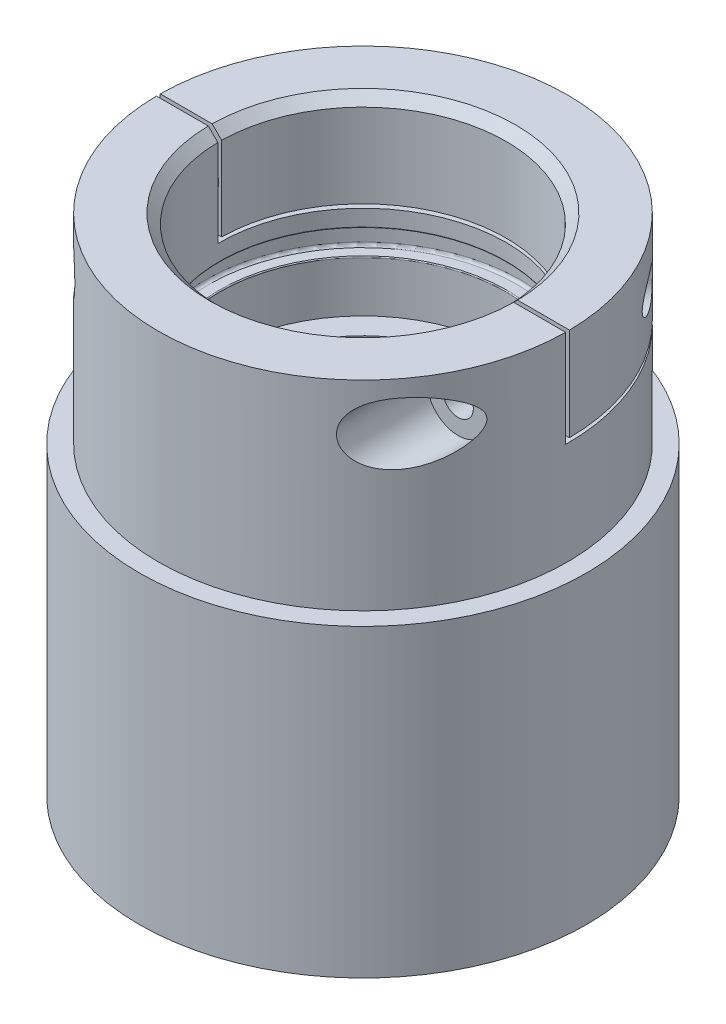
ISO-10303-21;
HEADER;
FILE_DESCRIPTION(('STEP AP214'),'2;1');
FILE_NAME('part.step','',(''),(''),'','','');
FILE_SCHEMA(('AUTOMOTIVE_DESIGN { 1 0 10303 214 1 1 1 1 }'));
ENDSEC;
DATA;
#1=APPLICATION_CONTEXT('core data for automotive mechanical design processes');
#2=APPLICATION_PROTOCOL_DEFINITION('international standard','automotive_design',2000,#1);
#3=PRODUCT_CONTEXT('',#1,'mechanical');
#4=PRODUCT('Part','Part','',(#3));
#5=PRODUCT_RELATED_PRODUCT_CATEGORY('part','',(#4));
#6=PRODUCT_DEFINITION_FORMATION('','',#4);
#7=PRODUCT_DEFINITION_CONTEXT('part definition',#1,'design');
#8=PRODUCT_DEFINITION('design','',#6,#7);
#9=PRODUCT_DEFINITION_SHAPE('','',#8);
#10=(LENGTH_UNIT() NAMED_UNIT(*) SI_UNIT(.MILLI.,.METRE.));
#11=(NAMED_UNIT(*) PLANE_ANGLE_UNIT() SI_UNIT($,.RADIAN.));
#12=(NAMED_UNIT(*) SI_UNIT($,.STERADIAN.) SOLID_ANGLE_UNIT());
#13=UNCERTAINTY_MEASURE_WITH_UNIT(LENGTH_MEASURE(1.E-05),#10,'distance_accuracy_value','');
#14=(GEOMETRIC_REPRESENTATION_CONTEXT(3) GLOBAL_UNCERTAINTY_ASSIGNED_CONTEXT((#13)) GLOBAL_UNIT_ASSIGNED_CONTEXT((#10,
#11,#12)) REPRESENTATION_CONTEXT('',''));
#15=CARTESIAN_POINT('',(0.,0.,0.));
#16=DIRECTION('',(0.,0.,1.));
#17=DIRECTION('',(1.,0.,0.));
#18=AXIS2_PLACEMENT_3D('',#15,#16,#17);
#19=CARTESIAN_POINT('',(0.,48.8191409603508,0.));
#20=DIRECTION('',(0.,1.,0.));
#21=DIRECTION('',(0.,0.,1.));
#22=AXIS2_PLACEMENT_3D('',#19,#20,#21);
#23=CYLINDRICAL_SURFACE('',#22,21.5);
#24=CARTESIAN_POINT('',(-20.25,48.,7.22409163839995));
#25=CARTESIAN_POINT('',(-20.2499949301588,47.9281450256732,7.22410732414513));
#26=CARTESIAN_POINT('',(-20.247582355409,47.8562103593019,7.23087951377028));
#27=CARTESIAN_POINT('',(-20.2382541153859,47.7149243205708,7.25694451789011));
#28=CARTESIAN_POINT('',(-20.2313277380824,47.6455795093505,7.27626711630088));
#29=CARTESIAN_POINT('',(-20.2112013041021,47.4917480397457,7.33201451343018));
#30=CARTESIAN_POINT('',(-20.1967686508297,47.4086552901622,7.37176278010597));
#31=CARTESIAN_POINT('',(-20.163336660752,47.250054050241,7.46272066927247));
#32=CARTESIAN_POINT('',(-20.144325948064,47.1745651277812,7.51395882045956));
#33=CARTESIAN_POINT('',(-20.1042578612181,47.0351206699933,7.62048910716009));
#34=CARTESIAN_POINT('',(-20.0834101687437,46.9707358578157,7.67530995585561));
#35=CARTESIAN_POINT('',(-20.0393448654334,46.847093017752,7.78963519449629));
#36=CARTESIAN_POINT('',(-20.0161250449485,46.7878398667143,7.84914393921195));
#37=CARTESIAN_POINT('',(-19.9676746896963,46.6736289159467,7.97159431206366));
#38=CARTESIAN_POINT('',(-19.9424400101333,46.6186804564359,8.03454292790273));
#39=CARTESIAN_POINT('',(-19.8902490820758,46.5125675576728,8.16289142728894));
#40=CARTESIAN_POINT('',(-19.8632921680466,46.4614045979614,8.22829225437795));
#41=CARTESIAN_POINT('',(-19.803114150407,46.3539551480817,8.3722004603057));
#42=CARTESIAN_POINT('',(-19.7696079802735,46.2982796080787,8.45104338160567));
#43=CARTESIAN_POINT('',(-19.7006603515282,46.1908566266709,8.61054850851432));
#44=CARTESIAN_POINT('',(-19.6652184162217,46.1391101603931,8.69121115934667));
#45=CARTESIAN_POINT('',(-19.5561161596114,45.9889983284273,8.93532600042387));
#46=CARTESIAN_POINT('',(-19.4797301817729,45.8958489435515,9.1007829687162));
#47=CARTESIAN_POINT('',(-19.3201955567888,45.7211483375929,9.43474407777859));
#48=CARTESIAN_POINT('',(-19.2370387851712,45.6396113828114,9.60325168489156));
#49=CARTESIAN_POINT('',(-19.0642901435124,45.4871382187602,9.94177843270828));
#50=CARTESIAN_POINT('',(-18.9746973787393,45.416203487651,10.1117977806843));
#51=CARTESIAN_POINT('',(-18.7753986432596,45.2746469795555,10.477789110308));
#52=CARTESIAN_POINT('',(-18.6646871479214,45.2056541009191,10.6738448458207));
#53=CARTESIAN_POINT('',(-18.4351569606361,45.0811185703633,11.0655564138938));
#54=CARTESIAN_POINT('',(-18.3163362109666,45.0255793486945,11.2612121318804));
#55=CARTESIAN_POINT('',(-18.0709994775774,44.9287090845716,11.6508327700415));
#56=CARTESIAN_POINT('',(-17.944494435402,44.8873583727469,11.8447996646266));
#57=CARTESIAN_POINT('',(-17.6839890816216,44.8199441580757,12.2303153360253));
#58=CARTESIAN_POINT('',(-17.5499908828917,44.7938763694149,12.4218647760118));
#59=CARTESIAN_POINT('',(-17.3050998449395,44.7625421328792,12.7599792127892));
#60=CARTESIAN_POINT('',(-17.1955618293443,44.7539735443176,12.9072217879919));
#61=CARTESIAN_POINT('',(-16.9726146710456,44.7482024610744,13.1990172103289));
#62=CARTESIAN_POINT('',(-16.8592053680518,44.7510004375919,13.3435699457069));
#63=CARTESIAN_POINT('',(-16.6291700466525,44.7691662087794,13.6291702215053));
#64=CARTESIAN_POINT('',(-16.5125462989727,44.7845253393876,13.7702201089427));
#65=CARTESIAN_POINT('',(-16.2769029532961,44.8291950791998,14.0479756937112));
#66=CARTESIAN_POINT('',(-16.1578841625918,44.8585010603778,14.1846828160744));
#67=CARTESIAN_POINT('',(-15.8648704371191,44.9492718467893,14.5128700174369));
#68=CARTESIAN_POINT('',(-15.6901293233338,45.0192614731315,14.7014565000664));
#69=CARTESIAN_POINT('',(-15.3435106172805,45.1970797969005,15.0628374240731));
#70=CARTESIAN_POINT('',(-15.1716290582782,45.3048505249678,15.2356555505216));
#71=CARTESIAN_POINT('',(-14.881312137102,45.5305054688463,15.5185963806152));
#72=CARTESIAN_POINT('',(-14.7603228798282,45.6389984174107,15.6335441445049));
#73=CARTESIAN_POINT('',(-14.5300738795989,45.8810866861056,15.8477623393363));
#74=CARTESIAN_POINT('',(-14.4207995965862,46.0146503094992,15.9470522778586));
#75=CARTESIAN_POINT('',(-14.2386325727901,46.2800308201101,16.1097333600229));
#76=CARTESIAN_POINT('',(-14.1627369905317,46.4077554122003,16.1763692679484));
#77=CARTESIAN_POINT('',(-14.0610598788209,46.6104428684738,16.2646431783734));
#78=CARTESIAN_POINT('',(-14.0291851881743,46.6798846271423,16.2921295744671));
#79=CARTESIAN_POINT('',(-13.969974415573,46.82213327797,16.3429292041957));
#80=CARTESIAN_POINT('',(-13.9426363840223,46.89493870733,16.3662442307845));
#81=CARTESIAN_POINT('',(-13.8927812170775,47.0440120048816,16.4085864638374));
#82=CARTESIAN_POINT('',(-13.8702995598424,47.1203007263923,16.4275821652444));
#83=CARTESIAN_POINT('',(-13.8308293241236,47.2752608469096,16.4608270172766));
#84=CARTESIAN_POINT('',(-13.8138381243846,47.3539310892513,16.4750784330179));
#85=CARTESIAN_POINT('',(-13.7856761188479,47.5130278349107,16.4986507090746));
#86=CARTESIAN_POINT('',(-13.7745042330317,47.5934540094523,16.507972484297));
#87=CARTESIAN_POINT('',(-13.7582017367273,47.7553103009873,16.5215612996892));
#88=CARTESIAN_POINT('',(-13.7530704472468,47.8367403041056,16.5258289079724));
#89=CARTESIAN_POINT('',(-13.7474000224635,48.0630699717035,16.53055003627));
#90=CARTESIAN_POINT('',(-13.7534827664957,48.208344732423,16.5255002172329));
#91=CARTESIAN_POINT('',(-13.7847092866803,48.4952446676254,16.499459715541));
#92=CARTESIAN_POINT('',(-13.8098497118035,48.6368704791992,16.4784718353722));
#93=CARTESIAN_POINT('',(-13.8768928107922,48.9099933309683,16.422049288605));
#94=CARTESIAN_POINT('',(-13.9184585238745,49.0416341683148,16.3869047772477));
#95=CARTESIAN_POINT('',(-14.0160427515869,49.2949713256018,16.3035164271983));
#96=CARTESIAN_POINT('',(-14.0720642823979,49.4166655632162,16.2552698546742));
#97=CARTESIAN_POINT('',(-14.2016977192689,49.6591023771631,16.1421750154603));
#98=CARTESIAN_POINT('',(-14.276463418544,49.7786959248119,16.0761975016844));
#99=CARTESIAN_POINT('',(-14.436639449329,50.0026687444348,15.9325157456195));
#100=CARTESIAN_POINT('',(-14.5220562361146,50.1070387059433,15.8548043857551));
#101=CARTESIAN_POINT('',(-14.7456277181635,50.349373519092,15.6476766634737));
#102=CARTESIAN_POINT('',(-14.8885844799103,50.4775859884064,15.5120053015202));
#103=CARTESIAN_POINT('',(-15.183148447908,50.7010932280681,15.2238187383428));
#104=CARTESIAN_POINT('',(-15.3347748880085,50.7963112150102,15.0712653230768));
#105=CARTESIAN_POINT('',(-15.5961667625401,50.9337317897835,14.7998045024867));
#106=CARTESIAN_POINT('',(-15.7053462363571,50.9833022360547,14.6839383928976));
#107=CARTESIAN_POINT('',(-15.923531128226,51.0687864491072,14.4470436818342));
#108=CARTESIAN_POINT('',(-16.0325364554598,51.104694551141,14.3260129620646));
#109=CARTESIAN_POINT('',(-16.2492429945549,51.1640946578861,14.0797384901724));
#110=CARTESIAN_POINT('',(-16.3569434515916,51.1875797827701,13.9544924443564));
#111=CARTESIAN_POINT('',(-16.570195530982,51.2232679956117,13.7005887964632));
#112=CARTESIAN_POINT('',(-16.6757464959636,51.2354676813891,13.5719301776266));
#113=CARTESIAN_POINT('',(-16.9337171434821,51.252980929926,13.2498932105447));
#114=CARTESIAN_POINT('',(-17.0845161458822,51.2522474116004,13.054875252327));
#115=CARTESIAN_POINT('',(-17.3788463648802,51.231215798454,12.6604245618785));
#116=CARTESIAN_POINT('',(-17.5223737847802,51.2109075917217,12.460989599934));
#117=CARTESIAN_POINT('',(-17.8018581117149,51.1527713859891,12.0583627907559));
#118=CARTESIAN_POINT('',(-17.9377863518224,51.1148814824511,11.8551601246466));
#119=CARTESIAN_POINT('',(-18.201030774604,51.0231525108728,11.446897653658));
#120=CARTESIAN_POINT('',(-18.3283491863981,50.9693175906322,11.2418383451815));
#121=CARTESIAN_POINT('',(-18.5792099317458,50.8441265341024,10.8224354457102));
#122=CARTESIAN_POINT('',(-18.7023794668,50.7721388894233,10.6080580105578));
#123=CARTESIAN_POINT('',(-18.9389676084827,50.6121522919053,10.1796544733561));
#124=CARTESIAN_POINT('',(-19.0523800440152,50.5241433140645,9.96562867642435));
#125=CARTESIAN_POINT('',(-19.2145450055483,50.379804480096,9.64704041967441));
#126=CARTESIAN_POINT('',(-19.2671421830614,50.3297897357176,9.54153605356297));
#127=CARTESIAN_POINT('',(-19.3697528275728,50.2253397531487,9.33146964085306));
#128=CARTESIAN_POINT('',(-19.4197666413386,50.1709051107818,9.22690746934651));
#129=CARTESIAN_POINT('',(-19.5170673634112,50.0572942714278,9.01926905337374));
#130=CARTESIAN_POINT('',(-19.5643572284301,49.9981233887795,8.91619129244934));
#131=CARTESIAN_POINT('',(-19.6561174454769,49.8744266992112,8.71203511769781));
#132=CARTESIAN_POINT('',(-19.7005887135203,49.8099026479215,8.61095606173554));
#133=CARTESIAN_POINT('',(-19.7664618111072,49.7061692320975,8.45815264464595));
#134=CARTESIAN_POINT('',(-19.7889533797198,49.6691814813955,8.40538725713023));
#135=CARTESIAN_POINT('',(-19.8330130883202,49.593255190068,8.30089219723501));
#136=CARTESIAN_POINT('',(-19.8545812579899,49.5543167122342,8.24916249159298));
#137=CARTESIAN_POINT('',(-19.9179069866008,49.4340719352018,8.09562919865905));
#138=CARTESIAN_POINT('',(-19.958187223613,49.3494888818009,7.99571071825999));
#139=CARTESIAN_POINT('',(-20.0343133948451,49.1684345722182,7.80302009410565));
#140=CARTESIAN_POINT('',(-20.070105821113,49.0718430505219,7.71033839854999));
#141=CARTESIAN_POINT('',(-20.1348386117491,48.8643039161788,7.53965977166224));
#142=CARTESIAN_POINT('',(-20.1638087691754,48.753422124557,7.4615993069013));
#143=CARTESIAN_POINT('',(-20.1998875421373,48.5720228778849,7.36314387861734));
#144=CARTESIAN_POINT('',(-20.21082092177,48.5076114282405,7.33303733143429));
#145=CARTESIAN_POINT('',(-20.229030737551,48.3746078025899,7.28265279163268));
#146=CARTESIAN_POINT('',(-20.2363177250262,48.3060283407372,7.2623464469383));
#147=CARTESIAN_POINT('',(-20.244237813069,48.197327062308,7.24022818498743));
#148=CARTESIAN_POINT('',(-20.2463890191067,48.1581484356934,7.23420708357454));
#149=CARTESIAN_POINT('',(-20.2492716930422,48.0793213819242,7.22613397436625));
#150=CARTESIAN_POINT('',(-20.2500027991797,48.0396728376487,7.22408297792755));
#151=CARTESIAN_POINT('',(-20.25,48.,7.22409163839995));
#152=B_SPLINE_CURVE_WITH_KNOTS('',3,(#24,#25,#26,#27,#28,#29,#30,#31,#32,#33,#34,#35,#36,#37,
#38,#39,#40,#41,#42,#43,#44,#45,#46,#47,#48,#49,#50,#51,#52,#53,#54,#55,#56,#57,#58,#59,#60,#61,
#62,#63,#64,#65,#66,#67,#68,#69,#70,#71,#72,#73,#74,#75,#76,#77,#78,#79,#80,#81,#82,#83,#84,#85,
#86,#87,#88,#89,#90,#91,#92,#93,#94,#95,#96,#97,#98,#99,#100,#101,#102,#103,#104,#105,#106,#107,
#108,#109,#110,#111,#112,#113,#114,#115,#116,#117,#118,#119,#120,#121,#122,#123,#124,#125,#126,
#127,#128,#129,#130,#131,#132,#133,#134,#135,#136,#137,#138,#139,#140,#141,#142,#143,#144,#145,
#146,#147,#148,#149,#150,#151),.UNSPECIFIED.,.T.,.F.,(4,2,2,2,2,2,2,2,2,2,2,2,2,2,2,2,2,2,2,2,2,
2,2,2,2,2,2,2,2,2,2,2,2,2,2,2,2,2,2,2,2,2,2,2,2,2,2,2,2,2,2,2,2,2,2,2,2,2,2,2,2,2,2,4),(0.,
0.215377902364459,0.431268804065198,0.709362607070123,0.988154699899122,1.24905264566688,
1.51019587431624,1.77189087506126,2.03368762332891,2.34006100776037,2.64651018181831,
3.25988425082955,3.87400548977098,4.48821226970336,5.19414881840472,5.90026516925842,
6.60539864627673,7.31033428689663,7.86112287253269,8.41193429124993,8.96236610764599,
9.51261539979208,10.30932935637,11.1048261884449,11.6998726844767,12.2941718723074,
12.7804857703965,13.0238321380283,13.2670736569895,13.5120361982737,13.7568816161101,
14.0016815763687,14.2464540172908,14.6805537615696,15.1145771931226,15.5401240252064,
15.9657597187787,16.4311234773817,16.8967706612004,17.5982222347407,18.3012954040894,
18.8008767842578,19.3006650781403,19.8007298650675,20.3009453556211,21.0394021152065,
21.7782405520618,22.5197003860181,23.2609675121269,24.0328324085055,24.8051819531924,
25.1892755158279,25.5733173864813,25.9569342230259,26.3404257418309,26.545138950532,
26.7498455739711,27.1601343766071,27.5749253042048,27.9878697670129,28.2030157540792,
28.4175355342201,28.5364205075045,28.6553357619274),.UNSPECIFIED.);
#153=CARTESIAN_POINT('',(-20.25,48.,7.22409163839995));
#154=VERTEX_POINT('',#153);
#155=EDGE_CURVE('E143',#154,#154,#152,.T.);
#156=ORIENTED_EDGE('',*,*,#155,.F.);
#157=EDGE_LOOP('',(#156));
#158=FACE_BOUND('',#157,.T.);
#159=CARTESIAN_POINT('',(0.,42.8,0.));
#160=DIRECTION('',(0.,-1.,0.));
#161=DIRECTION('',(0.,0.,-1.));
#162=AXIS2_PLACEMENT_3D('',#159,#160,#161);
#163=CIRCLE('',#162,21.5);
#164=CARTESIAN_POINT('',(-21.499069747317,42.8,0.199999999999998));
#165=VERTEX_POINT('',#164);
#166=CARTESIAN_POINT('',(21.499069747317,42.8,0.199999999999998));
#167=VERTEX_POINT('',#166);
#168=EDGE_CURVE('E153',#165,#167,#163,.T.);
#169=ORIENTED_EDGE('',*,*,#168,.T.);
#170=DIRECTION('',(0.,1.,0.));
#171=VECTOR('',#170,1.);
#172=CARTESIAN_POINT('',(21.499069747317,48.8191409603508,0.199999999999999));
#173=LINE('',#172,#171);
#174=CARTESIAN_POINT('',(21.499069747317,53.,0.2));
#175=VERTEX_POINT('',#174);
#176=EDGE_CURVE('E156',#167,#175,#173,.T.);
#177=ORIENTED_EDGE('',*,*,#176,.T.);
#178=CARTESIAN_POINT('',(0.,53.,0.));
#179=DIRECTION('',(0.,1.,0.));
#180=DIRECTION('',(0.,0.,1.));
#181=AXIS2_PLACEMENT_3D('',#178,#179,#180);
#182=CIRCLE('',#181,21.5);
#183=CARTESIAN_POINT('',(-21.499069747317,53.,0.2));
#184=VERTEX_POINT('',#183);
#185=EDGE_CURVE('E165',#184,#175,#182,.T.);
#186=ORIENTED_EDGE('',*,*,#185,.F.);
#187=DIRECTION('',(0.,1.,0.));
#188=VECTOR('',#187,1.);
#189=CARTESIAN_POINT('',(-21.499069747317,48.8191409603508,0.199999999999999));
#190=LINE('',#189,#188);
#191=EDGE_CURVE('E159',#184,#165,#190,.F.);
#192=ORIENTED_EDGE('',*,*,#191,.T.);
#193=EDGE_LOOP('',(#169,#177,#186,#192));
#194=FACE_BOUND('',#193,.T.);
#195=CARTESIAN_POINT('',(0.,32.,0.));
#196=DIRECTION('',(0.,1.,0.));
#197=DIRECTION('',(0.,0.,1.));
#198=AXIS2_PLACEMENT_3D('',#195,#196,#197);
#199=CIRCLE('',#198,21.5);
#200=CARTESIAN_POINT('',(0.,32.,21.5));
#201=VERTEX_POINT('',#200);
#202=EDGE_CURVE('E125',#201,#201,#199,.T.);
#203=ORIENTED_EDGE('',*,*,#202,.T.);
#204=EDGE_LOOP('',(#203));
#205=FACE_BOUND('',#204,.T.);
#206=CARTESIAN_POINT('',(20.25,48.,7.22409163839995));
#207=CARTESIAN_POINT('',(20.2499949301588,48.0718549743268,7.22410732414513));
#208=CARTESIAN_POINT('',(20.247582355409,48.1437896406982,7.23087951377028));
#209=CARTESIAN_POINT('',(20.2382541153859,48.2850756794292,7.25694451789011));
#210=CARTESIAN_POINT('',(20.2313277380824,48.3544204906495,7.27626711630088));
#211=CARTESIAN_POINT('',(20.2112013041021,48.5082519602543,7.33201451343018));
#212=CARTESIAN_POINT('',(20.1967686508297,48.5913447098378,7.37176278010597));
#213=CARTESIAN_POINT('',(20.163336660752,48.749945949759,7.46272066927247));
#214=CARTESIAN_POINT('',(20.144325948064,48.8254348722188,7.51395882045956));
#215=CARTESIAN_POINT('',(20.1042578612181,48.9648793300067,7.62048910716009));
#216=CARTESIAN_POINT('',(20.0834101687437,49.0292641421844,7.67530995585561));
#217=CARTESIAN_POINT('',(20.0393448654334,49.152906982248,7.78963519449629));
#218=CARTESIAN_POINT('',(20.0161250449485,49.2121601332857,7.84914393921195));
#219=CARTESIAN_POINT('',(19.9676746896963,49.3263710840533,7.97159431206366));
#220=CARTESIAN_POINT('',(19.9424400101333,49.3813195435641,8.03454292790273));
#221=CARTESIAN_POINT('',(19.8902490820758,49.4874324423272,8.16289142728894));
#222=CARTESIAN_POINT('',(19.8632921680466,49.5385954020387,8.22829225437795));
#223=CARTESIAN_POINT('',(19.803114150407,49.6460448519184,8.3722004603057));
#224=CARTESIAN_POINT('',(19.7696079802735,49.7017203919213,8.45104338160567));
#225=CARTESIAN_POINT('',(19.7006603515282,49.8091433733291,8.61054850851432));
#226=CARTESIAN_POINT('',(19.6652184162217,49.8608898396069,8.69121115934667));
#227=CARTESIAN_POINT('',(19.5561161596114,50.0110016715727,8.93532600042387));
#228=CARTESIAN_POINT('',(19.4797301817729,50.1041510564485,9.1007829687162));
#229=CARTESIAN_POINT('',(19.3201955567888,50.2788516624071,9.43474407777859));
#230=CARTESIAN_POINT('',(19.2370387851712,50.3603886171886,9.60325168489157));
#231=CARTESIAN_POINT('',(19.0642901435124,50.5128617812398,9.94177843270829));
#232=CARTESIAN_POINT('',(18.9746973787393,50.583796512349,10.1117977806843));
#233=CARTESIAN_POINT('',(18.7753986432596,50.7253530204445,10.477789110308));
#234=CARTESIAN_POINT('',(18.6646871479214,50.7943458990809,10.6738448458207));
#235=CARTESIAN_POINT('',(18.4351569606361,50.9188814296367,11.0655564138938));
#236=CARTESIAN_POINT('',(18.3163362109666,50.9744206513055,11.2612121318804));
#237=CARTESIAN_POINT('',(18.0709994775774,51.0712909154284,11.6508327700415));
#238=CARTESIAN_POINT('',(17.944494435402,51.1126416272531,11.8447996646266));
#239=CARTESIAN_POINT('',(17.6839890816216,51.1800558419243,12.2303153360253));
#240=CARTESIAN_POINT('',(17.5499908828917,51.2061236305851,12.4218647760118));
#241=CARTESIAN_POINT('',(17.3050998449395,51.2374578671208,12.7599792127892));
#242=CARTESIAN_POINT('',(17.1955618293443,51.2460264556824,12.9072217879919));
#243=CARTESIAN_POINT('',(16.9726146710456,51.2517975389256,13.1990172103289));
#244=CARTESIAN_POINT('',(16.8592053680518,51.2489995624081,13.3435699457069));
#245=CARTESIAN_POINT('',(16.6291700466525,51.2308337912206,13.6291702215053));
#246=CARTESIAN_POINT('',(16.5125462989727,51.2154746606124,13.7702201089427));
#247=CARTESIAN_POINT('',(16.2769029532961,51.1708049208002,14.0479756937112));
#248=CARTESIAN_POINT('',(16.1578841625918,51.1414989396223,14.1846828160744));
#249=CARTESIAN_POINT('',(15.8648704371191,51.0507281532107,14.5128700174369));
#250=CARTESIAN_POINT('',(15.6901293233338,50.9807385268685,14.7014565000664));
#251=CARTESIAN_POINT('',(15.3435106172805,50.8029202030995,15.0628374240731));
#252=CARTESIAN_POINT('',(15.1716290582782,50.6951494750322,15.2356555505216));
#253=CARTESIAN_POINT('',(14.881312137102,50.4694945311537,15.5185963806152));
#254=CARTESIAN_POINT('',(14.7603228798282,50.3610015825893,15.6335441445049));
#255=CARTESIAN_POINT('',(14.5300738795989,50.1189133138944,15.8477623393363));
#256=CARTESIAN_POINT('',(14.4207995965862,49.9853496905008,15.9470522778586));
#257=CARTESIAN_POINT('',(14.2386325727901,49.7199691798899,16.1097333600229));
#258=CARTESIAN_POINT('',(14.1627369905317,49.5922445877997,16.1763692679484));
#259=CARTESIAN_POINT('',(14.0610598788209,49.3895571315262,16.2646431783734));
#260=CARTESIAN_POINT('',(14.0291851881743,49.3201153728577,16.2921295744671));
#261=CARTESIAN_POINT('',(13.969974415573,49.1778667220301,16.3429292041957));
#262=CARTESIAN_POINT('',(13.9426363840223,49.10506129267,16.3662442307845));
#263=CARTESIAN_POINT('',(13.8927812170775,48.9559879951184,16.4085864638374));
#264=CARTESIAN_POINT('',(13.8702995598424,48.8796992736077,16.4275821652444));
#265=CARTESIAN_POINT('',(13.8308293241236,48.7247391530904,16.4608270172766));
#266=CARTESIAN_POINT('',(13.8138381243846,48.6460689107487,16.4750784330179));
#267=CARTESIAN_POINT('',(13.7856761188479,48.4869721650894,16.4986507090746));
#268=CARTESIAN_POINT('',(13.7745042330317,48.4065459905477,16.507972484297));
#269=CARTESIAN_POINT('',(13.7582017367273,48.2446896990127,16.5215612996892));
#270=CARTESIAN_POINT('',(13.7530704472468,48.1632596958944,16.5258289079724));
#271=CARTESIAN_POINT('',(13.7474000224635,47.9369300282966,16.53055003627));
#272=CARTESIAN_POINT('',(13.7534827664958,47.7916552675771,16.5255002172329));
#273=CARTESIAN_POINT('',(13.7847092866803,47.5047553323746,16.499459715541));
#274=CARTESIAN_POINT('',(13.8098497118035,47.3631295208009,16.4784718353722));
#275=CARTESIAN_POINT('',(13.8768928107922,47.0900066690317,16.422049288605));
#276=CARTESIAN_POINT('',(13.9184585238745,46.9583658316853,16.3869047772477));
#277=CARTESIAN_POINT('',(14.0160427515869,46.7050286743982,16.3035164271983));
#278=CARTESIAN_POINT('',(14.0720642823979,46.5833344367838,16.2552698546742));
#279=CARTESIAN_POINT('',(14.2016977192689,46.3408976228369,16.1421750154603));
#280=CARTESIAN_POINT('',(14.276463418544,46.2213040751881,16.0761975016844));
#281=CARTESIAN_POINT('',(14.436639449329,45.9973312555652,15.9325157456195));
#282=CARTESIAN_POINT('',(14.5220562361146,45.8929612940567,15.8548043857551));
#283=CARTESIAN_POINT('',(14.7456277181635,45.650626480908,15.6476766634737));
#284=CARTESIAN_POINT('',(14.8885844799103,45.5224140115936,15.5120053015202));
#285=CARTESIAN_POINT('',(15.183148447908,45.298906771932,15.2238187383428));
#286=CARTESIAN_POINT('',(15.3347748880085,45.2036887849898,15.0712653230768));
#287=CARTESIAN_POINT('',(15.5961667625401,45.0662682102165,14.7998045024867));
#288=CARTESIAN_POINT('',(15.7053462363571,45.0166977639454,14.6839383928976));
#289=CARTESIAN_POINT('',(15.923531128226,44.9312135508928,14.4470436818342));
#290=CARTESIAN_POINT('',(16.0325364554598,44.895305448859,14.3260129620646));
#291=CARTESIAN_POINT('',(16.2492429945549,44.8359053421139,14.0797384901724));
#292=CARTESIAN_POINT('',(16.3569434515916,44.8124202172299,13.9544924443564));
#293=CARTESIAN_POINT('',(16.570195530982,44.7767320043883,13.7005887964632));
#294=CARTESIAN_POINT('',(16.6757464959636,44.7645323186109,13.5719301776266));
#295=CARTESIAN_POINT('',(16.9337171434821,44.747019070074,13.2498932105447));
#296=CARTESIAN_POINT('',(17.0845161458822,44.7477525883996,13.054875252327));
#297=CARTESIAN_POINT('',(17.3788463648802,44.768784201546,12.6604245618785));
#298=CARTESIAN_POINT('',(17.5223737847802,44.7890924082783,12.460989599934));
#299=CARTESIAN_POINT('',(17.8018581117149,44.8472286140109,12.0583627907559));
#300=CARTESIAN_POINT('',(17.9377863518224,44.8851185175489,11.8551601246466));
#301=CARTESIAN_POINT('',(18.201030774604,44.9768474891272,11.446897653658));
#302=CARTESIAN_POINT('',(18.3283491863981,45.0306824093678,11.2418383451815));
#303=CARTESIAN_POINT('',(18.5792099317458,45.1558734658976,10.8224354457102));
#304=CARTESIAN_POINT('',(18.7023794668,45.2278611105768,10.6080580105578));
#305=CARTESIAN_POINT('',(18.9389676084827,45.3878477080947,10.1796544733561));
#306=CARTESIAN_POINT('',(19.0523800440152,45.4758566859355,9.96562867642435));
#307=CARTESIAN_POINT('',(19.2145450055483,45.620195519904,9.6470404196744));
#308=CARTESIAN_POINT('',(19.2671421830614,45.6702102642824,9.54153605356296));
#309=CARTESIAN_POINT('',(19.3697528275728,45.7746602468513,9.33146964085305));
#310=CARTESIAN_POINT('',(19.4197666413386,45.8290948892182,9.2269074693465));
#311=CARTESIAN_POINT('',(19.5170673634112,45.9427057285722,9.01926905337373));
#312=CARTESIAN_POINT('',(19.5643572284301,46.0018766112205,8.91619129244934));
#313=CARTESIAN_POINT('',(19.6561174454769,46.1255733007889,8.71203511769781));
#314=CARTESIAN_POINT('',(19.7005887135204,46.1900973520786,8.61095606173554));
#315=CARTESIAN_POINT('',(19.7664618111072,46.2938307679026,8.45815264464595));
#316=CARTESIAN_POINT('',(19.7889533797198,46.3308185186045,8.40538725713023));
#317=CARTESIAN_POINT('',(19.8330130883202,46.406744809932,8.30089219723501));
#318=CARTESIAN_POINT('',(19.8545812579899,46.4456832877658,8.24916249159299));
#319=CARTESIAN_POINT('',(19.9179069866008,46.5659280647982,8.09562919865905));
#320=CARTESIAN_POINT('',(19.958187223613,46.6505111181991,7.99571071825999));
#321=CARTESIAN_POINT('',(20.0343133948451,46.8315654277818,7.80302009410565));
#322=CARTESIAN_POINT('',(20.070105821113,46.9281569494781,7.71033839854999));
#323=CARTESIAN_POINT('',(20.1348386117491,47.1356960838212,7.53965977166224));
#324=CARTESIAN_POINT('',(20.1638087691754,47.2465778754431,7.4615993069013));
#325=CARTESIAN_POINT('',(20.1998875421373,47.4279771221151,7.36314387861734));
#326=CARTESIAN_POINT('',(20.21082092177,47.4923885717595,7.33303733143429));
#327=CARTESIAN_POINT('',(20.229030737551,47.6253921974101,7.28265279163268));
#328=CARTESIAN_POINT('',(20.2363177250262,47.6939716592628,7.2623464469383));
#329=CARTESIAN_POINT('',(20.244237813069,47.802672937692,7.24022818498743));
#330=CARTESIAN_POINT('',(20.2463890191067,47.8418515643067,7.23420708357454));
#331=CARTESIAN_POINT('',(20.2492716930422,47.9206786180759,7.22613397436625));
#332=CARTESIAN_POINT('',(20.2500027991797,47.9603271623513,7.22408297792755));
#333=CARTESIAN_POINT('',(20.25,48.,7.22409163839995));
#334=B_SPLINE_CURVE_WITH_KNOTS('',3,(#206,#207,#208,#209,#210,#211,#212,#213,#214,#215,#216,
#217,#218,#219,#220,#221,#222,#223,#224,#225,#226,#227,#228,#229,#230,#231,#232,#233,#234,#235,
#236,#237,#238,#239,#240,#241,#242,#243,#244,#245,#246,#247,#248,#249,#250,#251,#252,#253,#254,
#255,#256,#257,#258,#259,#260,#261,#262,#263,#264,#265,#266,#267,#268,#269,#270,#271,#272,#273,
#274,#275,#276,#277,#278,#279,#280,#281,#282,#283,#284,#285,#286,#287,#288,#289,#290,#291,#292,
#293,#294,#295,#296,#297,#298,#299,#300,#301,#302,#303,#304,#305,#306,#307,#308,#309,#310,#311,
#312,#313,#314,#315,#316,#317,#318,#319,#320,#321,#322,#323,#324,#325,#326,#327,#328,#329,#330,
#331,#332,#333),.UNSPECIFIED.,.T.,.F.,(4,2,2,2,2,2,2,2,2,2,2,2,2,2,2,2,2,2,2,2,2,2,2,2,2,2,2,2,
2,2,2,2,2,2,2,2,2,2,2,2,2,2,2,2,2,2,2,2,2,2,2,2,2,2,2,2,2,2,2,2,2,2,2,4),(0.,0.215377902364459,
0.431268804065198,0.709362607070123,0.988154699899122,1.24905264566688,1.51019587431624,
1.77189087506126,2.03368762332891,2.34006100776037,2.64651018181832,3.25988425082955,
3.87400548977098,4.48821226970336,5.19414881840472,5.90026516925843,6.60539864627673,
7.31033428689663,7.86112287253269,8.41193429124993,8.96236610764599,9.51261539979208,
10.30932935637,11.1048261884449,11.6998726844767,12.2941718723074,12.7804857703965,
13.0238321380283,13.2670736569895,13.5120361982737,13.7568816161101,14.0016815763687,
14.2464540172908,14.6805537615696,15.1145771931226,15.5401240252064,15.9657597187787,
16.4311234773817,16.8967706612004,17.5982222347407,18.3012954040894,18.8008767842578,
19.3006650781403,19.8007298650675,20.3009453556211,21.0394021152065,21.7782405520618,
22.5197003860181,23.2609675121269,24.0328324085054,24.8051819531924,25.1892755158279,
25.5733173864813,25.9569342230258,26.3404257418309,26.545138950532,26.7498455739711,
27.1601343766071,27.5749253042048,27.9878697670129,28.2030157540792,28.4175355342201,
28.5364205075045,28.6553357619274),.UNSPECIFIED.);
#335=CARTESIAN_POINT('',(20.25,48.,7.22409163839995));
#336=VERTEX_POINT('',#335);
#337=EDGE_CURVE('E142',#336,#336,#334,.T.);
#338=ORIENTED_EDGE('',*,*,#337,.F.);
#339=EDGE_LOOP('',(#338));
#340=FACE_BOUND('',#339,.T.);
#341=ADVANCED_FACE('F47',(#158,#194,#205,#340),#23,.T.);
#342=CARTESIAN_POINT('',(21.5,53.,0.));
#343=DIRECTION('',(0.,-1.,0.));
#344=DIRECTION('',(0.,0.,-1.));
#345=AXIS2_PLACEMENT_3D('',#342,#343,#344);
#346=PLANE('',#345);
#347=DIRECTION('',(1.,0.,0.));
#348=VECTOR('',#347,1.);
#349=CARTESIAN_POINT('',(-23.5,53.,0.2));
#350=LINE('',#349,#348);
#351=CARTESIAN_POINT('',(16.0487538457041,53.,0.2));
#352=VERTEX_POINT('',#351);
#353=EDGE_CURVE('E174',#352,#175,#350,.T.);
#354=ORIENTED_EDGE('',*,*,#353,.F.);
#355=CARTESIAN_POINT('',(0.,53.,0.));
#356=DIRECTION('',(0.,-1.,0.));
#357=DIRECTION('',(0.,0.,-1.));
#358=AXIS2_PLACEMENT_3D('',#355,#356,#357);
#359=CIRCLE('',#358,16.05);
#360=CARTESIAN_POINT('',(-16.0487538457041,53.,0.2));
#361=VERTEX_POINT('',#360);
#362=EDGE_CURVE('E60',#352,#361,#359,.T.);
#363=ORIENTED_EDGE('',*,*,#362,.T.);
#364=EDGE_CURVE('E173',#184,#361,#350,.T.);
#365=ORIENTED_EDGE('',*,*,#364,.F.);
#366=ORIENTED_EDGE('',*,*,#185,.T.);
#367=EDGE_LOOP('',(#354,#363,#365,#366));
#368=FACE_BOUND('',#367,.T.);
#369=ADVANCED_FACE('F226',(#368),#346,.F.);
#370=CARTESIAN_POINT('',(0.,48.8191409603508,0.));
#371=DIRECTION('',(0.,1.,0.));
#372=DIRECTION('',(0.,0.,1.));
#373=AXIS2_PLACEMENT_3D('',#370,#371,#372);
#374=CYLINDRICAL_SURFACE('',#373,15.05);
#375=CARTESIAN_POINT('',(0.,41.1,0.));
#376=DIRECTION('',(0.,1.,0.));
#377=DIRECTION('',(0.,0.,1.));
#378=AXIS2_PLACEMENT_3D('',#375,#376,#377);
#379=CIRCLE('',#378,15.05);
#380=CARTESIAN_POINT('',(0.,41.1,15.05));
#381=VERTEX_POINT('',#380);
#382=EDGE_CURVE('E203',#381,#381,#379,.F.);
#383=ORIENTED_EDGE('',*,*,#382,.T.);
#384=EDGE_LOOP('',(#383));
#385=FACE_BOUND('',#384,.T.);
#386=DIRECTION('',(0.,1.,0.));
#387=VECTOR('',#386,1.);
#388=CARTESIAN_POINT('',(-15.0486710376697,48.8191409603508,0.199999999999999));
#389=LINE('',#388,#387);
#390=CARTESIAN_POINT('',(-15.0486710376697,42.8,0.199999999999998));
#391=VERTEX_POINT('',#390);
#392=CARTESIAN_POINT('',(-15.0486710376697,52.,0.199999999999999));
#393=VERTEX_POINT('',#392);
#394=EDGE_CURVE('E166',#391,#393,#389,.T.);
#395=ORIENTED_EDGE('',*,*,#394,.T.);
#396=CARTESIAN_POINT('',(0.,52.,0.));
#397=DIRECTION('',(0.,-1.,0.));
#398=DIRECTION('',(0.,0.,-1.));
#399=AXIS2_PLACEMENT_3D('',#396,#397,#398);
#400=CIRCLE('',#399,15.05);
#401=CARTESIAN_POINT('',(15.0486710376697,52.,0.199999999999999));
#402=VERTEX_POINT('',#401);
#403=EDGE_CURVE('E206',#393,#402,#400,.F.);
#404=ORIENTED_EDGE('',*,*,#403,.T.);
#405=DIRECTION('',(0.,1.,0.));
#406=VECTOR('',#405,1.);
#407=CARTESIAN_POINT('',(15.0486710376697,48.8191409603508,0.199999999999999));
#408=LINE('',#407,#406);
#409=CARTESIAN_POINT('',(15.0486710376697,42.8,0.199999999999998));
#410=VERTEX_POINT('',#409);
#411=EDGE_CURVE('E162',#402,#410,#408,.F.);
#412=ORIENTED_EDGE('',*,*,#411,.T.);
#413=CARTESIAN_POINT('',(0.,42.8,0.));
#414=DIRECTION('',(0.,-1.,0.));
#415=DIRECTION('',(0.,0.,-1.));
#416=AXIS2_PLACEMENT_3D('',#413,#414,#415);
#417=CIRCLE('',#416,15.05);
#418=EDGE_CURVE('E164',#410,#391,#417,.F.);
#419=ORIENTED_EDGE('',*,*,#418,.T.);
#420=EDGE_LOOP('',(#395,#404,#412,#419));
#421=FACE_BOUND('',#420,.T.);
#422=ADVANCED_FACE('F221',(#385,#421),#374,.F.);
#423=CARTESIAN_POINT('',(15.05,41.,0.));
#424=DIRECTION('',(0.,1.,0.));
#425=DIRECTION('',(0.,0.,1.));
#426=AXIS2_PLACEMENT_3D('',#423,#424,#425);
#427=PLANE('',#426);
#428=CARTESIAN_POINT('',(0.,41.,0.));
#429=DIRECTION('',(0.,1.,0.));
#430=DIRECTION('',(0.,0.,1.));
#431=AXIS2_PLACEMENT_3D('',#428,#429,#430);
#432=CIRCLE('',#431,15.15);
#433=CARTESIAN_POINT('',(0.,41.,15.15));
#434=VERTEX_POINT('',#433);
#435=EDGE_CURVE('E200',#434,#434,#432,.T.);
#436=ORIENTED_EDGE('',*,*,#435,.T.);
#437=EDGE_LOOP('',(#436));
#438=FACE_BOUND('',#437,.T.);
#439=CARTESIAN_POINT('',(0.,41.,0.));
#440=DIRECTION('',(0.,1.,0.));
#441=DIRECTION('',(0.,0.,1.));
#442=AXIS2_PLACEMENT_3D('',#439,#440,#441);
#443=CIRCLE('',#442,16.2);
#444=CARTESIAN_POINT('',(0.,41.,16.2));
#445=VERTEX_POINT('',#444);
#446=EDGE_CURVE('E188',#445,#445,#443,.F.);
#447=ORIENTED_EDGE('',*,*,#446,.T.);
#448=EDGE_LOOP('',(#447));
#449=FACE_BOUND('',#448,.T.);
#450=ADVANCED_FACE('F225',(#438,#449),#427,.F.);
#451=CARTESIAN_POINT('',(0.,48.8191409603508,0.));
#452=DIRECTION('',(0.,1.,0.));
#453=DIRECTION('',(0.,0.,1.));
#454=AXIS2_PLACEMENT_3D('',#451,#452,#453);
#455=CYLINDRICAL_SURFACE('',#454,16.5);
#456=CARTESIAN_POINT('',(0.,40.7,0.));
#457=DIRECTION('',(0.,1.,0.));
#458=DIRECTION('',(0.,0.,1.));
#459=AXIS2_PLACEMENT_3D('',#456,#457,#458);
#460=CIRCLE('',#459,16.5);
#461=CARTESIAN_POINT('',(0.,40.7,16.5));
#462=VERTEX_POINT('',#461);
#463=EDGE_CURVE('E185',#462,#462,#460,.T.);
#464=ORIENTED_EDGE('',*,*,#463,.T.);
#465=EDGE_LOOP('',(#464));
#466=FACE_BOUND('',#465,.T.);
#467=CARTESIAN_POINT('',(0.,38.7,0.));
#468=DIRECTION('',(0.,-1.,0.));
#469=DIRECTION('',(0.,0.,-1.));
#470=AXIS2_PLACEMENT_3D('',#467,#468,#469);
#471=CIRCLE('',#470,16.5);
#472=CARTESIAN_POINT('',(0.,38.7,-16.5));
#473=VERTEX_POINT('',#472);
#474=EDGE_CURVE('E182',#473,#473,#471,.T.);
#475=ORIENTED_EDGE('',*,*,#474,.T.);
#476=EDGE_LOOP('',(#475));
#477=FACE_BOUND('',#476,.T.);
#478=ADVANCED_FACE('F329',(#466,#477),#455,.F.);
#479=CARTESIAN_POINT('',(16.5,38.4,0.));
#480=DIRECTION('',(0.,-1.,0.));
#481=DIRECTION('',(0.,0.,-1.));
#482=AXIS2_PLACEMENT_3D('',#479,#480,#481);
#483=PLANE('',#482);
#484=CARTESIAN_POINT('',(0.,38.4,0.));
#485=DIRECTION('',(0.,-1.,0.));
#486=DIRECTION('',(0.,0.,-1.));
#487=AXIS2_PLACEMENT_3D('',#484,#485,#486);
#488=CIRCLE('',#487,15.15);
#489=CARTESIAN_POINT('',(0.,38.4,-15.15));
#490=VERTEX_POINT('',#489);
#491=EDGE_CURVE('E197',#490,#490,#488,.T.);
#492=ORIENTED_EDGE('',*,*,#491,.T.);
#493=EDGE_LOOP('',(#492));
#494=FACE_BOUND('',#493,.T.);
#495=CARTESIAN_POINT('',(0.,38.4,0.));
#496=DIRECTION('',(0.,-1.,0.));
#497=DIRECTION('',(0.,0.,-1.));
#498=AXIS2_PLACEMENT_3D('',#495,#496,#497);
#499=CIRCLE('',#498,16.2);
#500=CARTESIAN_POINT('',(0.,38.4,-16.2));
#501=VERTEX_POINT('',#500);
#502=EDGE_CURVE('E191',#501,#501,#499,.F.);
#503=ORIENTED_EDGE('',*,*,#502,.T.);
#504=EDGE_LOOP('',(#503));
#505=FACE_BOUND('',#504,.T.);
#506=ADVANCED_FACE('F325',(#494,#505),#483,.F.);
#507=CARTESIAN_POINT('',(0.,48.8191409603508,0.));
#508=DIRECTION('',(0.,1.,0.));
#509=DIRECTION('',(0.,0.,1.));
#510=AXIS2_PLACEMENT_3D('',#507,#508,#509);
#511=CYLINDRICAL_SURFACE('',#510,15.05);
#512=CARTESIAN_POINT('',(0.,38.3,0.));
#513=DIRECTION('',(0.,-1.,0.));
#514=DIRECTION('',(0.,0.,-1.));
#515=AXIS2_PLACEMENT_3D('',#512,#513,#514);
#516=CIRCLE('',#515,15.05);
#517=CARTESIAN_POINT('',(0.,38.3,-15.05));
#518=VERTEX_POINT('',#517);
#519=EDGE_CURVE('E194',#518,#518,#516,.F.);
#520=ORIENTED_EDGE('',*,*,#519,.T.);
#521=EDGE_LOOP('',(#520));
#522=FACE_BOUND('',#521,.T.);
#523=CARTESIAN_POINT('',(0.,33.,0.));
#524=DIRECTION('',(0.,1.,0.));
#525=DIRECTION('',(0.,0.,1.));
#526=AXIS2_PLACEMENT_3D('',#523,#524,#525);
#527=CIRCLE('',#526,15.05);
#528=CARTESIAN_POINT('',(0.,33.,15.05));
#529=VERTEX_POINT('',#528);
#530=EDGE_CURVE('E169',#529,#529,#527,.T.);
#531=ORIENTED_EDGE('',*,*,#530,.F.);
#532=EDGE_LOOP('',(#531));
#533=FACE_BOUND('',#532,.T.);
#534=ADVANCED_FACE('F321',(#522,#533),#511,.F.);
#535=CARTESIAN_POINT('',(15.05,33.,0.));
#536=DIRECTION('',(0.,-1.,0.));
#537=DIRECTION('',(0.,0.,-1.));
#538=AXIS2_PLACEMENT_3D('',#535,#536,#537);
#539=PLANE('',#538);
#540=CARTESIAN_POINT('',(0.,33.,0.));
#541=DIRECTION('',(0.,1.,0.));
#542=DIRECTION('',(0.,0.,1.));
#543=AXIS2_PLACEMENT_3D('',#540,#541,#542);
#544=CIRCLE('',#543,12.5);
#545=CARTESIAN_POINT('',(0.,33.,12.5));
#546=VERTEX_POINT('',#545);
#547=EDGE_CURVE('E563',#546,#546,#544,.T.);
#548=ORIENTED_EDGE('',*,*,#547,.F.);
#549=EDGE_LOOP('',(#548));
#550=FACE_BOUND('',#549,.T.);
#551=ORIENTED_EDGE('',*,*,#530,.T.);
#552=EDGE_LOOP('',(#551));
#553=FACE_BOUND('',#552,.T.);
#554=ADVANCED_FACE('F317',(#550,#553),#539,.F.);
#555=CARTESIAN_POINT('',(0.,48.8191409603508,0.));
#556=DIRECTION('',(0.,1.,0.));
#557=DIRECTION('',(0.,0.,1.));
#558=AXIS2_PLACEMENT_3D('',#555,#556,#557);
#559=CYLINDRICAL_SURFACE('',#558,12.5);
#560=CARTESIAN_POINT('',(0.,30.,0.));
#561=DIRECTION('',(0.,1.,0.));
#562=DIRECTION('',(0.,0.,1.));
#563=AXIS2_PLACEMENT_3D('',#560,#561,#562);
#564=CIRCLE('',#563,12.5);
#565=CARTESIAN_POINT('',(0.,30.,12.5));
#566=VERTEX_POINT('',#565);
#567=EDGE_CURVE('E560',#566,#566,#564,.T.);
#568=ORIENTED_EDGE('',*,*,#567,.F.);
#569=EDGE_LOOP('',(#568));
#570=FACE_BOUND('',#569,.T.);
#571=ORIENTED_EDGE('',*,*,#547,.T.);
#572=EDGE_LOOP('',(#571));
#573=FACE_BOUND('',#572,.T.);
#574=ADVANCED_FACE('F313',(#570,#573),#559,.F.);
#575=CARTESIAN_POINT('',(12.5,30.,0.));
#576=DIRECTION('',(0.,1.,0.));
#577=DIRECTION('',(0.,0.,1.));
#578=AXIS2_PLACEMENT_3D('',#575,#576,#577);
#579=PLANE('',#578);
#580=CARTESIAN_POINT('',(0.,30.,0.));
#581=DIRECTION('',(0.,1.,0.));
#582=DIRECTION('',(0.,0.,1.));
#583=AXIS2_PLACEMENT_3D('',#580,#581,#582);
#584=CIRCLE('',#583,19.3);
#585=CARTESIAN_POINT('',(0.,30.,19.3));
#586=VERTEX_POINT('',#585);
#587=EDGE_CURVE('E557',#586,#586,#584,.T.);
#588=ORIENTED_EDGE('',*,*,#587,.F.);
#589=EDGE_LOOP('',(#588));
#590=FACE_BOUND('',#589,.T.);
#591=ORIENTED_EDGE('',*,*,#567,.T.);
#592=EDGE_LOOP('',(#591));
#593=FACE_BOUND('',#592,.T.);
#594=ADVANCED_FACE('F309',(#590,#593),#579,.F.);
#595=CARTESIAN_POINT('',(0.,48.8191409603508,0.));
#596=DIRECTION('',(0.,1.,0.));
#597=DIRECTION('',(0.,0.,1.));
#598=AXIS2_PLACEMENT_3D('',#595,#596,#597);
#599=CYLINDRICAL_SURFACE('',#598,19.3);
#600=CARTESIAN_POINT('',(0.,2.74747741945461,0.));
#601=DIRECTION('',(0.,1.,0.));
#602=DIRECTION('',(0.,0.,1.));
#603=AXIS2_PLACEMENT_3D('',#600,#601,#602);
#604=CIRCLE('',#603,19.3);
#605=CARTESIAN_POINT('',(0.,2.74747741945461,19.3));
#606=VERTEX_POINT('',#605);
#607=EDGE_CURVE('E552',#606,#606,#604,.T.);
#608=ORIENTED_EDGE('',*,*,#607,.F.);
#609=EDGE_LOOP('',(#608));
#610=FACE_BOUND('',#609,.T.);
#611=ORIENTED_EDGE('',*,*,#587,.T.);
#612=EDGE_LOOP('',(#611));
#613=FACE_BOUND('',#612,.T.);
#614=ADVANCED_FACE('F305',(#610,#613),#599,.F.);
#615=CARTESIAN_POINT('',(0.,2.74747741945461,0.));
#616=DIRECTION('',(0.,-1.,0.));
#617=DIRECTION('',(0.,0.,-1.));
#618=AXIS2_PLACEMENT_3D('',#615,#616,#617);
#619=CONICAL_SURFACE('',#618,19.3,0.349065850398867);
#620=CARTESIAN_POINT('',(0.,0.,0.));
#621=DIRECTION('',(0.,1.,0.));
#622=DIRECTION('',(0.,0.,1.));
#623=AXIS2_PLACEMENT_3D('',#620,#621,#622);
#624=CIRCLE('',#623,20.3);
#625=CARTESIAN_POINT('',(0.,0.,20.3));
#626=VERTEX_POINT('',#625);
#627=EDGE_CURVE('E549',#626,#626,#624,.T.);
#628=ORIENTED_EDGE('',*,*,#627,.F.);
#629=EDGE_LOOP('',(#628));
#630=FACE_BOUND('',#629,.T.);
#631=ORIENTED_EDGE('',*,*,#607,.T.);
#632=EDGE_LOOP('',(#631));
#633=FACE_BOUND('',#632,.T.);
#634=ADVANCED_FACE('F301',(#630,#633),#619,.F.);
#635=CARTESIAN_POINT('',(20.3,0.,0.));
#636=DIRECTION('',(0.,1.,0.));
#637=DIRECTION('',(0.,0.,1.));
#638=AXIS2_PLACEMENT_3D('',#635,#636,#637);
#639=PLANE('',#638);
#640=CARTESIAN_POINT('',(18.6195461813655,0.,10.7499999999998));
#641=DIRECTION('',(0.,-1.,0.));
#642=DIRECTION('',(0.,0.,-1.));
#643=AXIS2_PLACEMENT_3D('',#640,#641,#642);
#644=CIRCLE('',#643,0.799999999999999);
#645=CARTESIAN_POINT('',(18.6195461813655,0.,9.94999999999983));
#646=VERTEX_POINT('',#645);
#647=EDGE_CURVE('E135',#646,#646,#644,.T.);
#648=ORIENTED_EDGE('',*,*,#647,.F.);
#649=EDGE_LOOP('',(#648));
#650=FACE_BOUND('',#649,.T.);
#651=CARTESIAN_POINT('',(-18.6195461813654,0.,10.7500000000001));
#652=DIRECTION('',(0.,-1.,0.));
#653=DIRECTION('',(0.,0.,-1.));
#654=AXIS2_PLACEMENT_3D('',#651,#652,#653);
#655=CIRCLE('',#654,0.799999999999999);
#656=CARTESIAN_POINT('',(-18.6195461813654,0.,9.95000000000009));
#657=VERTEX_POINT('',#656);
#658=EDGE_CURVE('E129',#657,#657,#655,.T.);
#659=ORIENTED_EDGE('',*,*,#658,.F.);
#660=EDGE_LOOP('',(#659));
#661=FACE_BOUND('',#660,.T.);
#662=CARTESIAN_POINT('',(0.,0.,-21.5));
#663=DIRECTION('',(0.,-1.,0.));
#664=DIRECTION('',(0.,0.,-1.));
#665=AXIS2_PLACEMENT_3D('',#662,#663,#664);
#666=CIRCLE('',#665,0.799999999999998);
#667=CARTESIAN_POINT('',(0.,0.,-22.3));
#668=VERTEX_POINT('',#667);
#669=EDGE_CURVE('E115',#668,#668,#666,.T.);
#670=ORIENTED_EDGE('',*,*,#669,.F.);
#671=EDGE_LOOP('',(#670));
#672=FACE_BOUND('',#671,.T.);
#673=CARTESIAN_POINT('',(0.,0.,0.));
#674=DIRECTION('',(0.,1.,0.));
#675=DIRECTION('',(0.,0.,1.));
#676=AXIS2_PLACEMENT_3D('',#673,#674,#675);
#677=CIRCLE('',#676,23.5);
#678=CARTESIAN_POINT('',(0.,0.,23.5));
#679=VERTEX_POINT('',#678);
#680=EDGE_CURVE('E122',#679,#679,#677,.T.);
#681=ORIENTED_EDGE('',*,*,#680,.F.);
#682=EDGE_LOOP('',(#681));
#683=FACE_BOUND('',#682,.T.);
#684=ORIENTED_EDGE('',*,*,#627,.T.);
#685=EDGE_LOOP('',(#684));
#686=FACE_BOUND('',#685,.T.);
#687=ADVANCED_FACE('F297',(#650,#661,#672,#683,#686),#639,.F.);
#688=CARTESIAN_POINT('',(0.,48.8191409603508,0.));
#689=DIRECTION('',(0.,1.,0.));
#690=DIRECTION('',(0.,0.,1.));
#691=AXIS2_PLACEMENT_3D('',#688,#689,#690);
#692=CYLINDRICAL_SURFACE('',#691,23.5);
#693=CARTESIAN_POINT('',(0.,32.,0.));
#694=DIRECTION('',(0.,1.,0.));
#695=DIRECTION('',(0.,0.,1.));
#696=AXIS2_PLACEMENT_3D('',#693,#694,#695);
#697=CIRCLE('',#696,23.5);
#698=CARTESIAN_POINT('',(0.,32.,23.5));
#699=VERTEX_POINT('',#698);
#700=EDGE_CURVE('E116',#699,#699,#697,.T.);
#701=ORIENTED_EDGE('',*,*,#700,.F.);
#702=EDGE_LOOP('',(#701));
#703=FACE_BOUND('',#702,.T.);
#704=ORIENTED_EDGE('',*,*,#680,.T.);
#705=EDGE_LOOP('',(#704));
#706=FACE_BOUND('',#705,.T.);
#707=ADVANCED_FACE('F293',(#703,#706),#692,.T.);
#708=CARTESIAN_POINT('',(23.5,32.,0.));
#709=DIRECTION('',(0.,-1.,0.));
#710=DIRECTION('',(0.,0.,-1.));
#711=AXIS2_PLACEMENT_3D('',#708,#709,#710);
#712=PLANE('',#711);
#713=ORIENTED_EDGE('',*,*,#202,.F.);
#714=EDGE_LOOP('',(#713));
#715=FACE_BOUND('',#714,.T.);
#716=ORIENTED_EDGE('',*,*,#700,.T.);
#717=EDGE_LOOP('',(#716));
#718=FACE_BOUND('',#717,.T.);
#719=ADVANCED_FACE('F109',(#715,#718),#712,.F.);
#720=CARTESIAN_POINT('',(0.,7.5,-21.5));
#721=DIRECTION('',(0.,-1.,0.));
#722=DIRECTION('',(0.,0.,-1.));
#723=AXIS2_PLACEMENT_3D('',#720,#721,#722);
#724=CONICAL_SURFACE('',#723,0.799999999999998,1.02974425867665);
#725=CARTESIAN_POINT('',(0.,7.98068849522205,-21.5));
#726=VERTEX_POINT('',#725);
#727=VERTEX_LOOP('',#726);
#728=FACE_BOUND('',#727,.T.);
#729=CARTESIAN_POINT('',(0.,7.5,-21.5));
#730=DIRECTION('',(0.,-1.,0.));
#731=DIRECTION('',(0.,0.,-1.));
#732=AXIS2_PLACEMENT_3D('',#729,#730,#731);
#733=CIRCLE('',#732,0.799999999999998);
#734=CARTESIAN_POINT('',(0.,7.5,-22.3));
#735=VERTEX_POINT('',#734);
#736=EDGE_CURVE('E113',#735,#735,#733,.T.);
#737=ORIENTED_EDGE('',*,*,#736,.T.);
#738=EDGE_LOOP('',(#737));
#739=FACE_BOUND('',#738,.T.);
#740=ADVANCED_FACE('F105',(#728,#739),#724,.F.);
#741=CARTESIAN_POINT('',(0.,0.,-21.5));
#742=DIRECTION('',(0.,-1.,0.));
#743=DIRECTION('',(0.,0.,-1.));
#744=AXIS2_PLACEMENT_3D('',#741,#742,#743);
#745=CYLINDRICAL_SURFACE('',#744,0.799999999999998);
#746=ORIENTED_EDGE('',*,*,#736,.F.);
#747=EDGE_LOOP('',(#746));
#748=FACE_BOUND('',#747,.T.);
#749=ORIENTED_EDGE('',*,*,#669,.T.);
#750=EDGE_LOOP('',(#749));
#751=FACE_BOUND('',#750,.T.);
#752=ADVANCED_FACE('F108',(#748,#751),#745,.F.);
#753=CARTESIAN_POINT('',(-18.6195461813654,7.5,10.7500000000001));
#754=DIRECTION('',(0.,-1.,0.));
#755=DIRECTION('',(0.,0.,-1.));
#756=AXIS2_PLACEMENT_3D('',#753,#754,#755);
#757=CONICAL_SURFACE('',#756,0.799999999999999,1.02974425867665);
#758=CARTESIAN_POINT('',(-18.6195461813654,7.98068849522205,10.7500000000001));
#759=VERTEX_POINT('',#758);
#760=VERTEX_LOOP('',#759);
#761=FACE_BOUND('',#760,.T.);
#762=CARTESIAN_POINT('',(-18.6195461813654,7.5,10.7500000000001));
#763=DIRECTION('',(0.,-1.,0.));
#764=DIRECTION('',(0.,0.,-1.));
#765=AXIS2_PLACEMENT_3D('',#762,#763,#764);
#766=CIRCLE('',#765,0.799999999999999);
#767=CARTESIAN_POINT('',(-18.6195461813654,7.5,9.95000000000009));
#768=VERTEX_POINT('',#767);
#769=EDGE_CURVE('E119',#768,#768,#766,.T.);
#770=ORIENTED_EDGE('',*,*,#769,.T.);
#771=EDGE_LOOP('',(#770));
#772=FACE_BOUND('',#771,.T.);
#773=ADVANCED_FACE('F284',(#761,#772),#757,.F.);
#774=CARTESIAN_POINT('',(-18.6195461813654,0.,10.7500000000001));
#775=DIRECTION('',(0.,-1.,0.));
#776=DIRECTION('',(0.,0.,-1.));
#777=AXIS2_PLACEMENT_3D('',#774,#775,#776);
#778=CYLINDRICAL_SURFACE('',#777,0.799999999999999);
#779=ORIENTED_EDGE('',*,*,#769,.F.);
#780=EDGE_LOOP('',(#779));
#781=FACE_BOUND('',#780,.T.);
#782=ORIENTED_EDGE('',*,*,#658,.T.);
#783=EDGE_LOOP('',(#782));
#784=FACE_BOUND('',#783,.T.);
#785=ADVANCED_FACE('F280',(#781,#784),#778,.F.);
#786=CARTESIAN_POINT('',(18.6195461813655,7.5,10.7499999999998));
#787=DIRECTION('',(0.,-1.,0.));
#788=DIRECTION('',(0.,0.,-1.));
#789=AXIS2_PLACEMENT_3D('',#786,#787,#788);
#790=CONICAL_SURFACE('',#789,0.799999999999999,1.02974425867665);
#791=CARTESIAN_POINT('',(18.6195461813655,7.98068849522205,10.7499999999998));
#792=VERTEX_POINT('',#791);
#793=VERTEX_LOOP('',#792);
#794=FACE_BOUND('',#793,.T.);
#795=CARTESIAN_POINT('',(18.6195461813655,7.5,10.7499999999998));
#796=DIRECTION('',(0.,-1.,0.));
#797=DIRECTION('',(0.,0.,-1.));
#798=AXIS2_PLACEMENT_3D('',#795,#796,#797);
#799=CIRCLE('',#798,0.799999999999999);
#800=CARTESIAN_POINT('',(18.6195461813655,7.5,9.94999999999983));
#801=VERTEX_POINT('',#800);
#802=EDGE_CURVE('E132',#801,#801,#799,.T.);
#803=ORIENTED_EDGE('',*,*,#802,.T.);
#804=EDGE_LOOP('',(#803));
#805=FACE_BOUND('',#804,.T.);
#806=ADVANCED_FACE('F276',(#794,#805),#790,.F.);
#807=CARTESIAN_POINT('',(18.6195461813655,0.,10.7499999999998));
#808=DIRECTION('',(0.,-1.,0.));
#809=DIRECTION('',(0.,0.,-1.));
#810=AXIS2_PLACEMENT_3D('',#807,#808,#809);
#811=CYLINDRICAL_SURFACE('',#810,0.799999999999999);
#812=ORIENTED_EDGE('',*,*,#802,.F.);
#813=EDGE_LOOP('',(#812));
#814=FACE_BOUND('',#813,.T.);
#815=ORIENTED_EDGE('',*,*,#647,.T.);
#816=EDGE_LOOP('',(#815));
#817=FACE_BOUND('',#816,.T.);
#818=ADVANCED_FACE('F266',(#814,#817),#811,.F.);
#819=CARTESIAN_POINT('',(-17.,48.,-22.4362417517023));
#820=DIRECTION('',(0.,0.,-1.));
#821=DIRECTION('',(-1.,0.,0.));
#822=AXIS2_PLACEMENT_3D('',#819,#820,#821);
#823=CYLINDRICAL_SURFACE('',#822,3.25);
#824=CARTESIAN_POINT('',(-17.,48.,7.));
#825=DIRECTION('',(0.,0.,-1.));
#826=DIRECTION('',(-1.,0.,0.));
#827=AXIS2_PLACEMENT_3D('',#824,#825,#826);
#828=CIRCLE('',#827,3.25);
#829=CARTESIAN_POINT('',(-20.25,48.,7.));
#830=VERTEX_POINT('',#829);
#831=EDGE_CURVE('E138',#830,#830,#828,.T.);
#832=ORIENTED_EDGE('',*,*,#831,.T.);
#833=EDGE_LOOP('',(#832));
#834=FACE_BOUND('',#833,.T.);
#835=ORIENTED_EDGE('',*,*,#155,.T.);
#836=EDGE_LOOP('',(#835));
#837=FACE_BOUND('',#836,.T.);
#838=ADVANCED_FACE('F261',(#834,#837),#823,.F.);
#839=CARTESIAN_POINT('',(-17.,48.,-22.4362417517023));
#840=DIRECTION('',(0.,0.,-1.));
#841=DIRECTION('',(-1.,0.,0.));
#842=AXIS2_PLACEMENT_3D('',#839,#840,#841);
#843=CYLINDRICAL_SURFACE('',#842,1.6);
#844=CARTESIAN_POINT('',(-17.,48.,0.199999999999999));
#845=DIRECTION('',(0.,0.,1.));
#846=DIRECTION('',(0.,-1.,0.));
#847=AXIS2_PLACEMENT_3D('',#844,#845,#846);
#848=CIRCLE('',#847,1.6);
#849=CARTESIAN_POINT('',(-17.,46.4,0.199999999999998));
#850=VERTEX_POINT('',#849);
#851=EDGE_CURVE('E170',#850,#850,#848,.T.);
#852=ORIENTED_EDGE('',*,*,#851,.F.);
#853=EDGE_LOOP('',(#852));
#854=FACE_BOUND('',#853,.T.);
#855=CARTESIAN_POINT('',(-17.,48.,7.));
#856=DIRECTION('',(0.,0.,-1.));
#857=DIRECTION('',(-1.,0.,0.));
#858=AXIS2_PLACEMENT_3D('',#855,#856,#857);
#859=CIRCLE('',#858,1.6);
#860=CARTESIAN_POINT('',(-18.6,48.,7.));
#861=VERTEX_POINT('',#860);
#862=EDGE_CURVE('E139',#861,#861,#859,.T.);
#863=ORIENTED_EDGE('',*,*,#862,.F.);
#864=EDGE_LOOP('',(#863));
#865=FACE_BOUND('',#864,.T.);
#866=ADVANCED_FACE('F265',(#854,#865),#843,.F.);
#867=CARTESIAN_POINT('',(-15.4,48.,7.));
#868=DIRECTION('',(0.,0.,1.));
#869=DIRECTION('',(1.,0.,0.));
#870=AXIS2_PLACEMENT_3D('',#867,#868,#869);
#871=PLANE('',#870);
#872=ORIENTED_EDGE('',*,*,#862,.T.);
#873=EDGE_LOOP('',(#872));
#874=FACE_BOUND('',#873,.T.);
#875=ORIENTED_EDGE('',*,*,#831,.F.);
#876=EDGE_LOOP('',(#875));
#877=FACE_BOUND('',#876,.T.);
#878=ADVANCED_FACE('F253',(#874,#877),#871,.T.);
#879=CARTESIAN_POINT('',(17.,48.,-22.4362417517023));
#880=DIRECTION('',(0.,0.,-1.));
#881=DIRECTION('',(1.,0.,0.));
#882=AXIS2_PLACEMENT_3D('',#879,#880,#881);
#883=CYLINDRICAL_SURFACE('',#882,3.25);
#884=CARTESIAN_POINT('',(17.,48.,7.));
#885=DIRECTION('',(0.,0.,1.));
#886=DIRECTION('',(1.,0.,0.));
#887=AXIS2_PLACEMENT_3D('',#884,#885,#886);
#888=CIRCLE('',#887,3.25);
#889=CARTESIAN_POINT('',(20.25,48.,7.));
#890=VERTEX_POINT('',#889);
#891=EDGE_CURVE('E149',#890,#890,#888,.T.);
#892=ORIENTED_EDGE('',*,*,#891,.F.);
#893=EDGE_LOOP('',(#892));
#894=FACE_BOUND('',#893,.T.);
#895=ORIENTED_EDGE('',*,*,#337,.T.);
#896=EDGE_LOOP('',(#895));
#897=FACE_BOUND('',#896,.T.);
#898=ADVANCED_FACE('F248',(#894,#897),#883,.F.);
#899=CARTESIAN_POINT('',(17.,48.,-22.4362417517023));
#900=DIRECTION('',(0.,0.,-1.));
#901=DIRECTION('',(1.,0.,0.));
#902=AXIS2_PLACEMENT_3D('',#899,#900,#901);
#903=CYLINDRICAL_SURFACE('',#902,1.6);
#904=CARTESIAN_POINT('',(17.,48.,0.199999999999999));
#905=DIRECTION('',(0.,0.,1.));
#906=DIRECTION('',(0.,-1.,0.));
#907=AXIS2_PLACEMENT_3D('',#904,#905,#906);
#908=CIRCLE('',#907,1.6);
#909=CARTESIAN_POINT('',(17.,46.4,0.199999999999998));
#910=VERTEX_POINT('',#909);
#911=EDGE_CURVE('E176',#910,#910,#908,.T.);
#912=ORIENTED_EDGE('',*,*,#911,.F.);
#913=EDGE_LOOP('',(#912));
#914=FACE_BOUND('',#913,.T.);
#915=CARTESIAN_POINT('',(17.,48.,7.));
#916=DIRECTION('',(0.,0.,1.));
#917=DIRECTION('',(1.,0.,0.));
#918=AXIS2_PLACEMENT_3D('',#915,#916,#917);
#919=CIRCLE('',#918,1.6);
#920=CARTESIAN_POINT('',(18.6,48.,7.));
#921=VERTEX_POINT('',#920);
#922=EDGE_CURVE('E146',#921,#921,#919,.T.);
#923=ORIENTED_EDGE('',*,*,#922,.T.);
#924=EDGE_LOOP('',(#923));
#925=FACE_BOUND('',#924,.T.);
#926=ADVANCED_FACE('F252',(#914,#925),#903,.F.);
#927=CARTESIAN_POINT('',(15.4,48.,7.));
#928=DIRECTION('',(0.,0.,1.));
#929=DIRECTION('',(-1.,0.,0.));
#930=AXIS2_PLACEMENT_3D('',#927,#928,#929);
#931=PLANE('',#930);
#932=ORIENTED_EDGE('',*,*,#922,.F.);
#933=EDGE_LOOP('',(#932));
#934=FACE_BOUND('',#933,.T.);
#935=ORIENTED_EDGE('',*,*,#891,.T.);
#936=EDGE_LOOP('',(#935));
#937=FACE_BOUND('',#936,.T.);
#938=ADVANCED_FACE('F255',(#934,#937),#931,.T.);
#939=CARTESIAN_POINT('',(-23.5,42.8,0.));
#940=DIRECTION('',(0.,-1.,0.));
#941=DIRECTION('',(0.,0.,-1.));
#942=AXIS2_PLACEMENT_3D('',#939,#940,#941);
#943=PLANE('',#942);
#944=DIRECTION('',(1.,0.,0.));
#945=VECTOR('',#944,1.);
#946=CARTESIAN_POINT('',(-23.5,42.8,0.199999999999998));
#947=LINE('',#946,#945);
#948=EDGE_CURVE('E152',#165,#391,#947,.T.);
#949=ORIENTED_EDGE('',*,*,#948,.T.);
#950=ORIENTED_EDGE('',*,*,#418,.F.);
#951=EDGE_CURVE('E177',#410,#167,#947,.T.);
#952=ORIENTED_EDGE('',*,*,#951,.T.);
#953=ORIENTED_EDGE('',*,*,#168,.F.);
#954=EDGE_LOOP('',(#949,#950,#952,#953));
#955=FACE_BOUND('',#954,.T.);
#956=ADVANCED_FACE('F218',(#955),#943,.F.);
#957=CARTESIAN_POINT('',(-23.5,53.,0.2));
#958=DIRECTION('',(0.,0.,1.));
#959=DIRECTION('',(0.,-1.,0.));
#960=AXIS2_PLACEMENT_3D('',#957,#958,#959);
#961=PLANE('',#960);
#962=ORIENTED_EDGE('',*,*,#911,.T.);
#963=EDGE_LOOP('',(#962));
#964=FACE_BOUND('',#963,.T.);
#965=ORIENTED_EDGE('',*,*,#411,.F.);
#966=CARTESIAN_POINT('',(15.0486710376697,52.,0.199999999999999));
#967=CARTESIAN_POINT('',(15.2153519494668,52.1666662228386,0.199999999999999));
#968=CARTESIAN_POINT('',(15.3820326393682,52.3333326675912,0.2));
#969=CARTESIAN_POINT('',(15.7153935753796,52.6666660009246,0.2));
#970=CARTESIAN_POINT('',(15.8820738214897,52.8333328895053,0.2));
#971=CARTESIAN_POINT('',(16.0487538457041,53.,0.2));
#972=B_SPLINE_CURVE_WITH_KNOTS('',3,(#966,#967,#968,#969,#970,#971),.UNSPECIFIED.,.F.,.F.,(4,2,
4),(0.,0.707136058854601,1.41427211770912),.UNSPECIFIED.);
#973=EDGE_CURVE('E74',#402,#352,#972,.T.);
#974=ORIENTED_EDGE('',*,*,#973,.T.);
#975=ORIENTED_EDGE('',*,*,#353,.T.);
#976=ORIENTED_EDGE('',*,*,#176,.F.);
#977=ORIENTED_EDGE('',*,*,#951,.F.);
#978=EDGE_LOOP('',(#965,#974,#975,#976,#977));
#979=FACE_BOUND('',#978,.T.);
#980=ADVANCED_FACE('F212',(#964,#979),#961,.F.);
#981=ORIENTED_EDGE('',*,*,#851,.T.);
#982=EDGE_LOOP('',(#981));
#983=FACE_BOUND('',#982,.T.);
#984=ORIENTED_EDGE('',*,*,#364,.T.);
#985=CARTESIAN_POINT('',(-16.0487538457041,53.,0.2));
#986=CARTESIAN_POINT('',(-15.8820738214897,52.8333328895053,0.2));
#987=CARTESIAN_POINT('',(-15.7153935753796,52.6666660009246,0.2));
#988=CARTESIAN_POINT('',(-15.3820326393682,52.3333326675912,0.2));
#989=CARTESIAN_POINT('',(-15.2153519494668,52.1666662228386,0.2));
#990=CARTESIAN_POINT('',(-15.0486710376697,52.,0.2));
#991=B_SPLINE_CURVE_WITH_KNOTS('',3,(#985,#986,#987,#988,#989,#990),.UNSPECIFIED.,.F.,.F.,(4,2,
4),(0.,0.70713605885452,1.41427211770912),.UNSPECIFIED.);
#992=EDGE_CURVE('E13',#361,#393,#991,.T.);
#993=ORIENTED_EDGE('',*,*,#992,.T.);
#994=ORIENTED_EDGE('',*,*,#394,.F.);
#995=ORIENTED_EDGE('',*,*,#948,.F.);
#996=ORIENTED_EDGE('',*,*,#191,.F.);
#997=EDGE_LOOP('',(#984,#993,#994,#995,#996));
#998=FACE_BOUND('',#997,.T.);
#999=ADVANCED_FACE('F217',(#983,#998),#961,.F.);
#1000=CARTESIAN_POINT('',(0.,40.7,0.));
#1001=DIRECTION('',(0.,1.,0.));
#1002=DIRECTION('',(0.,0.,1.));
#1003=AXIS2_PLACEMENT_3D('',#1000,#1001,#1002);
#1004=TOROIDAL_SURFACE('',#1003,16.2,0.3);
#1005=ORIENTED_EDGE('',*,*,#446,.F.);
#1006=EDGE_LOOP('',(#1005));
#1007=FACE_BOUND('',#1006,.T.);
#1008=ORIENTED_EDGE('',*,*,#463,.F.);
#1009=EDGE_LOOP('',(#1008));
#1010=FACE_BOUND('',#1009,.T.);
#1011=ADVANCED_FACE('F234',(#1007,#1010),#1004,.F.);
#1012=CARTESIAN_POINT('',(0.,38.7,0.));
#1013=DIRECTION('',(0.,-1.,0.));
#1014=DIRECTION('',(0.,0.,-1.));
#1015=AXIS2_PLACEMENT_3D('',#1012,#1013,#1014);
#1016=TOROIDAL_SURFACE('',#1015,16.2,0.3);
#1017=ORIENTED_EDGE('',*,*,#474,.F.);
#1018=EDGE_LOOP('',(#1017));
#1019=FACE_BOUND('',#1018,.T.);
#1020=ORIENTED_EDGE('',*,*,#502,.F.);
#1021=EDGE_LOOP('',(#1020));
#1022=FACE_BOUND('',#1021,.T.);
#1023=ADVANCED_FACE('F344',(#1019,#1022),#1016,.F.);
#1024=CARTESIAN_POINT('',(0.,38.3,0.));
#1025=DIRECTION('',(0.,-1.,0.));
#1026=DIRECTION('',(0.,0.,-1.));
#1027=AXIS2_PLACEMENT_3D('',#1024,#1025,#1026);
#1028=TOROIDAL_SURFACE('',#1027,15.15,0.1);
#1029=ORIENTED_EDGE('',*,*,#491,.F.);
#1030=EDGE_LOOP('',(#1029));
#1031=FACE_BOUND('',#1030,.T.);
#1032=ORIENTED_EDGE('',*,*,#519,.F.);
#1033=EDGE_LOOP('',(#1032));
#1034=FACE_BOUND('',#1033,.T.);
#1035=ADVANCED_FACE('F351',(#1031,#1034),#1028,.T.);
#1036=CARTESIAN_POINT('',(0.,41.1,0.));
#1037=DIRECTION('',(0.,1.,0.));
#1038=DIRECTION('',(0.,0.,1.));
#1039=AXIS2_PLACEMENT_3D('',#1036,#1037,#1038);
#1040=TOROIDAL_SURFACE('',#1039,15.15,0.1);
#1041=ORIENTED_EDGE('',*,*,#382,.F.);
#1042=EDGE_LOOP('',(#1041));
#1043=FACE_BOUND('',#1042,.T.);
#1044=ORIENTED_EDGE('',*,*,#435,.F.);
#1045=EDGE_LOOP('',(#1044));
#1046=FACE_BOUND('',#1045,.T.);
#1047=ADVANCED_FACE('F357',(#1043,#1046),#1040,.T.);
#1048=CARTESIAN_POINT('',(0.,52.,0.));
#1049=DIRECTION('',(0.,1.,0.));
#1050=DIRECTION('',(0.,0.,1.));
#1051=AXIS2_PLACEMENT_3D('',#1048,#1049,#1050);
#1052=CONICAL_SURFACE('',#1051,15.05,0.785398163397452);
#1053=ORIENTED_EDGE('',*,*,#992,.F.);
#1054=ORIENTED_EDGE('',*,*,#362,.F.);
#1055=ORIENTED_EDGE('',*,*,#973,.F.);
#1056=ORIENTED_EDGE('',*,*,#403,.F.);
#1057=EDGE_LOOP('',(#1053,#1054,#1055,#1056));
#1058=FACE_BOUND('',#1057,.T.);
#1059=ADVANCED_FACE('F49',(#1058),#1052,.F.);
#1060=CLOSED_SHELL('',(#341,#369,#422,#450,#478,#506,#534,#554,#574,#594,#614,#634,#687,#707,
#719,#740,#752,#773,#785,#806,#818,#838,#866,#878,#898,#926,#938,#956,#980,#999,#1011,#1023,
#1035,#1047,#1059));
#1061=MANIFOLD_SOLID_BREP('B2',#1060);
#1062=CARTESIAN_POINT('',(0.,48.8191409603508,0.));
#1063=DIRECTION('',(0.,1.,0.));
#1064=DIRECTION('',(0.,0.,1.));
#1065=AXIS2_PLACEMENT_3D('',#1062,#1063,#1064);
#1066=CYLINDRICAL_SURFACE('',#1065,15.05);
#1067=DIRECTION('',(0.,1.,0.));
#1068=VECTOR('',#1067,1.);
#1069=CARTESIAN_POINT('',(15.0486710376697,48.8191409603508,-0.200000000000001));
#1070=LINE('',#1069,#1068);
#1071=CARTESIAN_POINT('',(15.0486710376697,52.,-0.200000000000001));
#1072=VERTEX_POINT('',#1071);
#1073=CARTESIAN_POINT('',(15.0486710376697,43.2,-0.200000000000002));
#1074=VERTEX_POINT('',#1073);
#1075=EDGE_CURVE('E668',#1072,#1074,#1070,.F.);
#1076=ORIENTED_EDGE('',*,*,#1075,.F.);
#1077=CARTESIAN_POINT('',(0.,52.,0.));
#1078=DIRECTION('',(0.,-1.,0.));
#1079=DIRECTION('',(0.,0.,-1.));
#1080=AXIS2_PLACEMENT_3D('',#1077,#1078,#1079);
#1081=CIRCLE('',#1080,15.05);
#1082=CARTESIAN_POINT('',(-15.0486710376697,52.,-0.200000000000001));
#1083=VERTEX_POINT('',#1082);
#1084=EDGE_CURVE('E675',#1072,#1083,#1081,.F.);
#1085=ORIENTED_EDGE('',*,*,#1084,.T.);
#1086=DIRECTION('',(0.,1.,0.));
#1087=VECTOR('',#1086,1.);
#1088=CARTESIAN_POINT('',(-15.0486710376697,48.8191409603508,-0.200000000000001));
#1089=LINE('',#1088,#1087);
#1090=CARTESIAN_POINT('',(-15.0486710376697,43.2,-0.200000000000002));
#1091=VERTEX_POINT('',#1090);
#1092=EDGE_CURVE('E720',#1091,#1083,#1089,.T.);
#1093=ORIENTED_EDGE('',*,*,#1092,.F.);
#1094=CARTESIAN_POINT('',(0.,43.2,0.));
#1095=DIRECTION('',(0.,-1.,0.));
#1096=DIRECTION('',(0.,0.,-1.));
#1097=AXIS2_PLACEMENT_3D('',#1094,#1095,#1096);
#1098=CIRCLE('',#1097,15.05);
#1099=EDGE_CURVE('E672',#1074,#1091,#1098,.F.);
#1100=ORIENTED_EDGE('',*,*,#1099,.F.);
#1101=EDGE_LOOP('',(#1076,#1085,#1093,#1100));
#1102=FACE_BOUND('',#1101,.T.);
#1103=ADVANCED_FACE('F603',(#1102),#1066,.F.);
#1104=CARTESIAN_POINT('',(21.5,53.,0.));
#1105=DIRECTION('',(0.,-1.,0.));
#1106=DIRECTION('',(0.,0.,-1.));
#1107=AXIS2_PLACEMENT_3D('',#1104,#1105,#1106);
#1108=PLANE('',#1107);
#1109=DIRECTION('',(1.,0.,0.));
#1110=VECTOR('',#1109,1.);
#1111=CARTESIAN_POINT('',(-23.5,53.,-0.2));
#1112=LINE('',#1111,#1110);
#1113=CARTESIAN_POINT('',(-21.499069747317,53.,-0.2));
#1114=VERTEX_POINT('',#1113);
#1115=CARTESIAN_POINT('',(-16.0487538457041,53.,-0.2));
#1116=VERTEX_POINT('',#1115);
#1117=EDGE_CURVE('E650',#1114,#1116,#1112,.T.);
#1118=ORIENTED_EDGE('',*,*,#1117,.T.);
#1119=CARTESIAN_POINT('',(0.,53.,0.));
#1120=DIRECTION('',(0.,-1.,0.));
#1121=DIRECTION('',(0.,0.,-1.));
#1122=AXIS2_PLACEMENT_3D('',#1119,#1120,#1121);
#1123=CIRCLE('',#1122,16.05);
#1124=CARTESIAN_POINT('',(16.0487538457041,53.,-0.2));
#1125=VERTEX_POINT('',#1124);
#1126=EDGE_CURVE('E616',#1116,#1125,#1123,.T.);
#1127=ORIENTED_EDGE('',*,*,#1126,.T.);
#1128=CARTESIAN_POINT('',(21.499069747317,53.,-0.2));
#1129=VERTEX_POINT('',#1128);
#1130=EDGE_CURVE('E658',#1125,#1129,#1112,.T.);
#1131=ORIENTED_EDGE('',*,*,#1130,.T.);
#1132=CARTESIAN_POINT('',(0.,53.,0.));
#1133=DIRECTION('',(0.,1.,0.));
#1134=DIRECTION('',(0.,0.,1.));
#1135=AXIS2_PLACEMENT_3D('',#1132,#1133,#1134);
#1136=CIRCLE('',#1135,21.5);
#1137=EDGE_CURVE('E665',#1129,#1114,#1136,.T.);
#1138=ORIENTED_EDGE('',*,*,#1137,.T.);
#1139=EDGE_LOOP('',(#1118,#1127,#1131,#1138));
#1140=FACE_BOUND('',#1139,.T.);
#1141=ADVANCED_FACE('F670',(#1140),#1108,.F.);
#1142=CARTESIAN_POINT('',(17.,48.,0.));
#1143=DIRECTION('',(0.,0.,1.));
#1144=DIRECTION('',(1.,0.,0.));
#1145=AXIS2_PLACEMENT_3D('',#1142,#1143,#1144);
#1146=CYLINDRICAL_SURFACE('',#1145,1.64999999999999);
#1147=CARTESIAN_POINT('',(18.65,48.,-10.6970790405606));
#1148=CARTESIAN_POINT('',(18.6499967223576,48.0498030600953,-10.6970851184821));
#1149=CARTESIAN_POINT('',(18.6477207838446,48.0996410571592,-10.7010557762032));
#1150=CARTESIAN_POINT('',(18.6388513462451,48.1977537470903,-10.7164963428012));
#1151=CARTESIAN_POINT('',(18.6322515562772,48.2460260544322,-10.7279771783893));
#1152=CARTESIAN_POINT('',(18.6132460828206,48.3513693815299,-10.7609250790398));
#1153=CARTESIAN_POINT('',(18.5998139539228,48.4076976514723,-10.7841498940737));
#1154=CARTESIAN_POINT('',(18.5684757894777,48.5153083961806,-10.8380201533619));
#1155=CARTESIAN_POINT('',(18.550560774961,48.5665804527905,-10.868680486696));
#1156=CARTESIAN_POINT('',(18.4998347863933,48.6928063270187,-10.9549002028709));
#1157=CARTESIAN_POINT('',(18.4644624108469,48.7639377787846,-11.0144934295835));
#1158=CARTESIAN_POINT('',(18.3880932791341,48.8952566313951,-11.1415247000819));
#1159=CARTESIAN_POINT('',(18.3470822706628,48.9554153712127,-11.2089825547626));
#1160=CARTESIAN_POINT('',(18.26512269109,49.0611245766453,-11.3419931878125));
#1161=CARTESIAN_POINT('',(18.2245433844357,49.1075219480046,-11.4071109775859));
#1162=CARTESIAN_POINT('',(18.1406974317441,49.1937029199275,-11.5399860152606));
#1163=CARTESIAN_POINT('',(18.0974287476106,49.2334814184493,-11.6077452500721));
#1164=CARTESIAN_POINT('',(18.008576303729,49.3071371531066,-11.7451217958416));
#1165=CARTESIAN_POINT('',(17.9629884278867,49.3410033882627,-11.8147422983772));
#1166=CARTESIAN_POINT('',(17.8698539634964,49.403206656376,-11.9551421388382));
#1167=CARTESIAN_POINT('',(17.8223068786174,49.4315422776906,-12.0259217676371));
#1168=CARTESIAN_POINT('',(17.7053226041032,49.4936708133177,-12.197802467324));
#1169=CARTESIAN_POINT('',(17.6350085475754,49.5248291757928,-12.299266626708));
#1170=CARTESIAN_POINT('',(17.4913601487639,49.5769918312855,-12.50271358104));
#1171=CARTESIAN_POINT('',(17.4180243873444,49.5979912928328,-12.6046965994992));
#1172=CARTESIAN_POINT('',(17.2688409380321,49.6297348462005,-12.8083192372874));
#1173=CARTESIAN_POINT('',(17.1929951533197,49.6404865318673,-12.9099590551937));
#1174=CARTESIAN_POINT('',(17.0392715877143,49.6513294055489,-13.1121837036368));
#1175=CARTESIAN_POINT('',(16.9613947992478,49.6514257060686,-13.2127690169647));
#1176=CARTESIAN_POINT('',(16.7707029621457,49.6378547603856,-13.4545977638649));
#1177=CARTESIAN_POINT('',(16.6571028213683,49.6183218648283,-13.5949567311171));
#1178=CARTESIAN_POINT('',(16.4295930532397,49.5527782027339,-13.869029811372));
#1179=CARTESIAN_POINT('',(16.3156845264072,49.5068214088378,-14.0027568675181));
#1180=CARTESIAN_POINT('',(16.1281760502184,49.4035276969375,-14.2177819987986));
#1181=CARTESIAN_POINT('',(16.053408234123,49.3546214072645,-14.3020958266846));
#1182=CARTESIAN_POINT('',(15.908267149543,49.240611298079,-14.4633575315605));
#1183=CARTESIAN_POINT('',(15.8378882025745,49.1755289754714,-14.5403149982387));
#1184=CARTESIAN_POINT('',(15.7222597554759,49.046581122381,-14.6651238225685));
#1185=CARTESIAN_POINT('',(15.6751952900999,48.9866864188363,-14.7153773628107));
#1186=CARTESIAN_POINT('',(15.5877088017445,48.8567630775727,-14.8080172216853));
#1187=CARTESIAN_POINT('',(15.5472775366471,48.7867488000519,-14.8504144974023));
#1188=CARTESIAN_POINT('',(15.482782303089,48.6519045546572,-14.9176133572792));
#1189=CARTESIAN_POINT('',(15.4570628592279,48.5887820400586,-14.9442363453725));
#1190=CARTESIAN_POINT('',(15.4131148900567,48.457264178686,-14.9895593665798));
#1191=CARTESIAN_POINT('',(15.3948819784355,48.3888719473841,-15.0082640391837));
#1192=CARTESIAN_POINT('',(15.367159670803,48.2480156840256,-15.0366489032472));
#1193=CARTESIAN_POINT('',(15.3577261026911,48.1755287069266,-15.046271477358));
#1194=CARTESIAN_POINT('',(15.3486376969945,48.0293141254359,-15.0555427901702));
#1195=CARTESIAN_POINT('',(15.3489789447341,47.9555870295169,-15.0551955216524));
#1196=CARTESIAN_POINT('',(15.3588478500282,47.8171459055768,-15.0451263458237));
#1197=CARTESIAN_POINT('',(15.3674230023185,47.7522874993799,-15.0363764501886));
#1198=CARTESIAN_POINT('',(15.3917782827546,47.6254394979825,-15.0114443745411));
#1199=CARTESIAN_POINT('',(15.4075590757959,47.5634501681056,-14.9952615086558));
#1200=CARTESIAN_POINT('',(15.4460517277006,47.4414415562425,-14.9556099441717));
#1201=CARTESIAN_POINT('',(15.468994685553,47.3815758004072,-14.9318977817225));
#1202=CARTESIAN_POINT('',(15.5203591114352,47.2671250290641,-14.8785022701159));
#1203=CARTESIAN_POINT('',(15.5487834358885,47.2125427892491,-14.8488158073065));
#1204=CARTESIAN_POINT('',(15.6259275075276,47.0819586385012,-14.7676982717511));
#1205=CARTESIAN_POINT('',(15.6774946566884,47.0096546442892,-14.713007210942));
#1206=CARTESIAN_POINT('',(15.7871789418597,46.8779722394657,-14.5952563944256));
#1207=CARTESIAN_POINT('',(15.8453116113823,46.8186254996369,-14.5321767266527));
#1208=CARTESIAN_POINT('',(15.9922799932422,46.6883302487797,-14.3705786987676));
#1209=CARTESIAN_POINT('',(16.083282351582,46.6239406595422,-14.2687662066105));
#1210=CARTESIAN_POINT('',(16.2686050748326,46.5170866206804,-14.0571120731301));
#1211=CARTESIAN_POINT('',(16.3629304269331,46.4746567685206,-13.9472580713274));
#1212=CARTESIAN_POINT('',(16.5264648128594,46.4177246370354,-13.7527276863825));
#1213=CARTESIAN_POINT('',(16.5956008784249,46.3987793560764,-13.6692326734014));
#1214=CARTESIAN_POINT('',(16.7333806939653,46.3701628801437,-13.5002168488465));
#1215=CARTESIAN_POINT('',(16.8020241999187,46.3604960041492,-13.41469511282));
#1216=CARTESIAN_POINT('',(16.9383730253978,46.3497309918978,-13.2421163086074));
#1217=CARTESIAN_POINT('',(17.0060761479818,46.3486503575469,-13.1550564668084));
#1218=CARTESIAN_POINT('',(17.1399857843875,46.354583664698,-12.9801009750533));
#1219=CARTESIAN_POINT('',(17.2061925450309,46.3615962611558,-12.8922054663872));
#1220=CARTESIAN_POINT('',(17.3389678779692,46.3837447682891,-12.7131046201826));
#1221=CARTESIAN_POINT('',(17.4054752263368,46.3991431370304,-12.6218864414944));
#1222=CARTESIAN_POINT('',(17.5362545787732,46.4380819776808,-12.4395484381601));
#1223=CARTESIAN_POINT('',(17.6005260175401,46.4616244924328,-12.3484286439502));
#1224=CARTESIAN_POINT('',(17.7262797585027,46.5168549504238,-12.1672152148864));
#1225=CARTESIAN_POINT('',(17.7877708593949,46.5485147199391,-12.0771191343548));
#1226=CARTESIAN_POINT('',(17.907787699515,46.6203934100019,-11.8984329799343));
#1227=CARTESIAN_POINT('',(17.9663152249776,46.6606070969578,-11.8098420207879));
#1228=CARTESIAN_POINT('',(18.0787474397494,46.7494661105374,-11.6369799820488));
#1229=CARTESIAN_POINT('',(18.1327224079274,46.7979212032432,-11.5526575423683));
#1230=CARTESIAN_POINT('',(18.2367653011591,46.905227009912,-11.3877078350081));
#1231=CARTESIAN_POINT('',(18.2868216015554,46.964107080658,-11.3070918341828));
#1232=CARTESIAN_POINT('',(18.3581268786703,47.0621057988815,-11.1906793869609));
#1233=CARTESIAN_POINT('',(18.3814332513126,47.0966962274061,-11.1523442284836));
#1234=CARTESIAN_POINT('',(18.4263096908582,47.169354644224,-11.0780417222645));
#1235=CARTESIAN_POINT('',(18.4478788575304,47.2074244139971,-11.0420756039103));
#1236=CARTESIAN_POINT('',(18.5091747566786,47.3270390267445,-10.9392262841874));
#1237=CARTESIAN_POINT('',(18.5458810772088,47.4144981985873,-10.8767499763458));
#1238=CARTESIAN_POINT('',(18.5895939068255,47.5551425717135,-10.8017504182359));
#1239=CARTESIAN_POINT('',(18.6020275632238,47.6019070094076,-10.7803068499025));
#1240=CARTESIAN_POINT('',(18.6230155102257,47.6987381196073,-10.7440088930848));
#1241=CARTESIAN_POINT('',(18.6315786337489,47.7487969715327,-10.7291395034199));
#1242=CARTESIAN_POINT('',(18.6418253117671,47.8326715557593,-10.7113217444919));
#1243=CARTESIAN_POINT('',(18.6448763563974,47.8658295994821,-10.7060078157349));
#1244=CARTESIAN_POINT('',(18.6489649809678,47.9326530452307,-10.6988841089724));
#1245=CARTESIAN_POINT('',(18.650002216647,47.966318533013,-10.6970749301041));
#1246=CARTESIAN_POINT('',(18.65,48.,-10.6970790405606));
#1247=B_SPLINE_CURVE_WITH_KNOTS('',3,(#1147,#1148,#1149,#1150,#1151,#1152,#1153,#1154,#1155,
#1156,#1157,#1158,#1159,#1160,#1161,#1162,#1163,#1164,#1165,#1166,#1167,#1168,#1169,#1170,#1171,
#1172,#1173,#1174,#1175,#1176,#1177,#1178,#1179,#1180,#1181,#1182,#1183,#1184,#1185,#1186,#1187,
#1188,#1189,#1190,#1191,#1192,#1193,#1194,#1195,#1196,#1197,#1198,#1199,#1200,#1201,#1202,#1203,
#1204,#1205,#1206,#1207,#1208,#1209,#1210,#1211,#1212,#1213,#1214,#1215,#1216,#1217,#1218,#1219,
#1220,#1221,#1222,#1223,#1224,#1225,#1226,#1227,#1228,#1229,#1230,#1231,#1232,#1233,#1234,#1235,
#1236,#1237,#1238,#1239,#1240,#1241,#1242,#1243,#1244,#1245,#1246),.UNSPECIFIED.,.T.,.F.,(4,2,2,
2,2,2,2,2,2,2,2,2,2,2,2,2,2,2,2,2,2,2,2,2,2,2,2,2,2,2,2,2,2,2,2,2,2,2,2,2,2,2,2,2,2,2,2,2,2,4),
(0.,0.149271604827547,0.298760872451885,0.484883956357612,0.671382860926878,0.967646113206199,
1.26467246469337,1.53328709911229,1.80210784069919,2.07142356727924,2.34080794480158,
2.722273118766,3.10391953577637,3.48528292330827,3.86646333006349,4.40961093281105,
4.95165304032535,5.31914113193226,5.68614344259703,5.95899800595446,6.23146910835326,
6.45012280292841,6.66864820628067,6.88855080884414,7.10836534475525,7.3054752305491,
7.50260330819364,7.70689720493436,7.91129785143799,8.22243124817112,8.53431682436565,
8.98476098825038,9.43591268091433,9.76563804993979,10.095516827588,10.4260678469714,
10.756563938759,11.098053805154,11.4396293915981,11.7800351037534,12.1202331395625,
12.4534407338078,12.7876020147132,12.957372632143,13.1272306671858,13.4642498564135,
13.6225411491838,13.7804693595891,13.8814034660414,13.9823548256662),.UNSPECIFIED.);
#1248=CARTESIAN_POINT('',(18.65,48.,-10.6970790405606));
#1249=VERTEX_POINT('',#1248);
#1250=EDGE_CURVE('E678',#1249,#1249,#1247,.T.);
#1251=ORIENTED_EDGE('',*,*,#1250,.F.);
#1252=EDGE_LOOP('',(#1251));
#1253=FACE_BOUND('',#1252,.T.);
#1254=CARTESIAN_POINT('',(17.,48.,-0.200000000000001));
#1255=DIRECTION('',(0.,0.,1.));
#1256=DIRECTION('',(0.,-1.,0.));
#1257=AXIS2_PLACEMENT_3D('',#1254,#1255,#1256);
#1258=CIRCLE('',#1257,1.64999999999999);
#1259=CARTESIAN_POINT('',(17.,46.35,-0.200000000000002));
#1260=VERTEX_POINT('',#1259);
#1261=EDGE_CURVE('E657',#1260,#1260,#1258,.F.);
#1262=ORIENTED_EDGE('',*,*,#1261,.F.);
#1263=EDGE_LOOP('',(#1262));
#1264=FACE_BOUND('',#1263,.T.);
#1265=ADVANCED_FACE('F696',(#1253,#1264),#1146,.F.);
#1266=CARTESIAN_POINT('',(-17.,48.,0.));
#1267=DIRECTION('',(0.,0.,1.));
#1268=DIRECTION('',(1.,0.,0.));
#1269=AXIS2_PLACEMENT_3D('',#1266,#1267,#1268);
#1270=CYLINDRICAL_SURFACE('',#1269,1.64999999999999);
#1271=CARTESIAN_POINT('',(-15.35,48.,-15.0541522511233));
#1272=CARTESIAN_POINT('',(-15.3500024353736,48.0725064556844,-15.0541500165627));
#1273=CARTESIAN_POINT('',(-15.3548181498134,48.1450299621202,-15.0492441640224));
#1274=CARTESIAN_POINT('',(-15.3736612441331,48.2875818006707,-15.0299937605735));
#1275=CARTESIAN_POINT('',(-15.3876944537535,48.3576085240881,-15.0156432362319));
#1276=CARTESIAN_POINT('',(-15.4237399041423,48.4927145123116,-14.9786147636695));
#1277=CARTESIAN_POINT('',(-15.4457030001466,48.557821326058,-14.9559880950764));
#1278=CARTESIAN_POINT('',(-15.4961967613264,48.6823492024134,-14.9036642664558));
#1279=CARTESIAN_POINT('',(-15.5247304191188,48.7417676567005,-14.873963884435));
#1280=CARTESIAN_POINT('',(-15.5991068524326,48.8763539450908,-14.7960048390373));
#1281=CARTESIAN_POINT('',(-15.6473580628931,48.9486132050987,-14.745027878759));
#1282=CARTESIAN_POINT('',(-15.7505526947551,49.0809512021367,-14.634747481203));
#1283=CARTESIAN_POINT('',(-15.8055095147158,49.1410048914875,-14.5754273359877));
#1284=CARTESIAN_POINT('',(-15.9444973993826,49.2732679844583,-14.4235098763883));
#1285=CARTESIAN_POINT('',(-16.0307651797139,49.3393771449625,-14.3276729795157));
#1286=CARTESIAN_POINT('',(-16.2071360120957,49.4507855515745,-14.1278665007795));
#1287=CARTESIAN_POINT('',(-16.2972456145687,49.4960475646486,-14.023882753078));
#1288=CARTESIAN_POINT('',(-16.4543475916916,49.5588101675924,-13.8388967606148));
#1289=CARTESIAN_POINT('',(-16.5211484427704,49.5804874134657,-13.7590931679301));
#1290=CARTESIAN_POINT('',(-16.6545246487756,49.6148975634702,-13.5973451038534));
#1291=CARTESIAN_POINT('',(-16.7210998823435,49.6276262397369,-13.5153996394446));
#1292=CARTESIAN_POINT('',(-16.853526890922,49.6448434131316,-13.3499020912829));
#1293=CARTESIAN_POINT('',(-16.9193774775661,49.6493199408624,-13.2663478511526));
#1294=CARTESIAN_POINT('',(-17.0498390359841,49.6505364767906,-13.0982558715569));
#1295=CARTESIAN_POINT('',(-17.1144501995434,49.6472776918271,-13.0137182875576));
#1296=CARTESIAN_POINT('',(-17.2444209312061,49.6331516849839,-12.8410296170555));
#1297=CARTESIAN_POINT('',(-17.3097236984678,49.6220147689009,-12.7528580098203));
#1298=CARTESIAN_POINT('',(-17.4383638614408,49.5920737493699,-12.5763822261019));
#1299=CARTESIAN_POINT('',(-17.5017011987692,49.5732694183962,-12.4880780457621));
#1300=CARTESIAN_POINT('',(-17.6260330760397,49.5280553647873,-12.311968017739));
#1301=CARTESIAN_POINT('',(-17.687030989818,49.5016571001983,-12.224161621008));
#1302=CARTESIAN_POINT('',(-17.8064498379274,49.4410482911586,-12.0495447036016));
#1303=CARTESIAN_POINT('',(-17.8648718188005,49.406840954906,-11.9627337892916));
#1304=CARTESIAN_POINT('',(-17.990033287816,49.3225390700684,-11.7738664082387));
#1305=CARTESIAN_POINT('',(-18.0561383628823,49.2706413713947,-11.6721829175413));
#1306=CARTESIAN_POINT('',(-18.1831548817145,49.153315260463,-11.4733053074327));
#1307=CARTESIAN_POINT('',(-18.2440679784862,49.0878911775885,-11.3761097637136));
#1308=CARTESIAN_POINT('',(-18.3433774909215,48.9604635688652,-11.2150315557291));
#1309=CARTESIAN_POINT('',(-18.3834331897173,48.9022428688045,-11.1492023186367));
#1310=CARTESIAN_POINT('',(-18.4582807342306,48.7754525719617,-11.0248391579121));
#1311=CARTESIAN_POINT('',(-18.4930847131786,48.7069075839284,-10.9662884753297));
#1312=CARTESIAN_POINT('',(-18.5430215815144,48.5865495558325,-10.8815339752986));
#1313=CARTESIAN_POINT('',(-18.560573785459,48.5384306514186,-10.8515467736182));
#1314=CARTESIAN_POINT('',(-18.5917963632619,48.4375624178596,-10.7979657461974));
#1315=CARTESIAN_POINT('',(-18.6054724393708,48.3848200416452,-10.7743625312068));
#1316=CARTESIAN_POINT('',(-18.6259161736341,48.2846728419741,-10.7389755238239));
#1317=CARTESIAN_POINT('',(-18.633466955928,48.2379072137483,-10.7258579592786));
#1318=CARTESIAN_POINT('',(-18.6445344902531,48.1424959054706,-10.7066082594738));
#1319=CARTESIAN_POINT('',(-18.6480551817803,48.0938521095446,-10.7004693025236));
#1320=CARTESIAN_POINT('',(-18.650723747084,47.9959119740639,-10.6958175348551));
#1321=CARTESIAN_POINT('',(-18.6498575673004,47.9466140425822,-10.6973292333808));
#1322=CARTESIAN_POINT('',(-18.6438129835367,47.849096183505,-10.7078602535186));
#1323=CARTESIAN_POINT('',(-18.6386315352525,47.8008770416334,-10.7168848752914));
#1324=CARTESIAN_POINT('',(-18.6230704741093,47.6977410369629,-10.7439065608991));
#1325=CARTESIAN_POINT('',(-18.6118836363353,47.6433164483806,-10.7632939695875));
#1326=CARTESIAN_POINT('',(-18.5851610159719,47.5388170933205,-10.8093708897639));
#1327=CARTESIAN_POINT('',(-18.5696170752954,47.4887507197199,-10.8360740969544));
#1328=CARTESIAN_POINT('',(-18.5258887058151,47.3673058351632,-10.9107364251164));
#1329=CARTESIAN_POINT('',(-18.4954148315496,47.2990481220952,-10.9623801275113));
#1330=CARTESIAN_POINT('',(-18.429126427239,47.1722077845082,-11.0734600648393));
#1331=CARTESIAN_POINT('',(-18.3932983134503,47.1136505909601,-11.1329160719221));
#1332=CARTESIAN_POINT('',(-18.3216107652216,47.0103654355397,-11.2504595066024));
#1333=CARTESIAN_POINT('',(-18.2861187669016,46.9648383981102,-11.308080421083));
#1334=CARTESIAN_POINT('',(-18.2126394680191,46.8796553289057,-11.4260491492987));
#1335=CARTESIAN_POINT('',(-18.1746502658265,46.8400038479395,-11.4863990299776));
#1336=CARTESIAN_POINT('',(-18.0965462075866,46.7659062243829,-11.609061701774));
#1337=CARTESIAN_POINT('',(-18.0564276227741,46.7314696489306,-11.6713778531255));
#1338=CARTESIAN_POINT('',(-17.9744012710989,46.6674278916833,-11.7973112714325));
#1339=CARTESIAN_POINT('',(-17.9324929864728,46.6378241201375,-11.8609289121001));
#1340=CARTESIAN_POINT('',(-17.8242392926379,46.5684985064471,-12.023329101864));
#1341=CARTESIAN_POINT('',(-17.7568179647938,46.531839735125,-12.1227114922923));
#1342=CARTESIAN_POINT('',(-17.6187738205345,46.4685357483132,-12.3224824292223));
#1343=CARTESIAN_POINT('',(-17.5481492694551,46.4418960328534,-12.4228714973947));
#1344=CARTESIAN_POINT('',(-17.4041530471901,46.3984963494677,-12.6238161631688));
#1345=CARTESIAN_POINT('',(-17.3307813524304,46.3817364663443,-12.7243717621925));
#1346=CARTESIAN_POINT('',(-17.1817420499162,46.3583065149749,-12.9249114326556));
#1347=CARTESIAN_POINT('',(-17.1060753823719,46.3516323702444,-13.0248957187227));
#1348=CARTESIAN_POINT('',(-16.9691602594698,46.3491852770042,-13.2025520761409));
#1349=CARTESIAN_POINT('',(-16.9082537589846,46.3514022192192,-13.2804630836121));
#1350=CARTESIAN_POINT('',(-16.7856292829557,46.3628265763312,-13.4351174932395));
#1351=CARTESIAN_POINT('',(-16.7239114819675,46.3720325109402,-13.5118611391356));
#1352=CARTESIAN_POINT('',(-16.6001615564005,46.3979330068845,-13.6636086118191));
#1353=CARTESIAN_POINT('',(-16.5381301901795,46.4146141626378,-13.7386153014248));
#1354=CARTESIAN_POINT('',(-16.4142146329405,46.4561017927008,-13.8864271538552));
#1355=CARTESIAN_POINT('',(-16.3523303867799,46.4809044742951,-13.9592333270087));
#1356=CARTESIAN_POINT('',(-16.2110989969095,46.548122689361,-14.1232137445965));
#1357=CARTESIAN_POINT('',(-16.1320282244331,46.5935820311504,-14.2134158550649));
#1358=CARTESIAN_POINT('',(-15.9776679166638,46.7014685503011,-14.3867137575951));
#1359=CARTESIAN_POINT('',(-15.9023738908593,46.7638749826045,-14.4698180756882));
#1360=CARTESIAN_POINT('',(-15.7772600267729,46.8895202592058,-14.6059704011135));
#1361=CARTESIAN_POINT('',(-15.7257961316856,46.9486019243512,-14.6613208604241));
#1362=CARTESIAN_POINT('',(-15.6293196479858,47.0779271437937,-14.7641224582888));
#1363=CARTESIAN_POINT('',(-15.5842981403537,47.1481549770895,-14.8115845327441));
#1364=CARTESIAN_POINT('',(-15.512293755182,47.283227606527,-14.8869359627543));
#1365=CARTESIAN_POINT('',(-15.4835137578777,47.3459822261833,-14.9168394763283));
#1366=CARTESIAN_POINT('',(-15.4333538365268,47.4774572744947,-14.9687305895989));
#1367=CARTESIAN_POINT('',(-15.4119656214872,47.5461709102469,-14.9907270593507));
#1368=CARTESIAN_POINT('',(-15.3803661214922,47.6786148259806,-15.0231416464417));
#1369=CARTESIAN_POINT('',(-15.369049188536,47.74179856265,-15.0347079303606));
#1370=CARTESIAN_POINT('',(-15.3538656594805,47.8699838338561,-15.0502135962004));
#1371=CARTESIAN_POINT('',(-15.3499978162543,47.9349850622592,-15.0541542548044));
#1372=CARTESIAN_POINT('',(-15.35,48.,-15.0541522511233));
#1373=B_SPLINE_CURVE_WITH_KNOTS('',3,(#1271,#1272,#1273,#1274,#1275,#1276,#1277,#1278,#1279,
#1280,#1281,#1282,#1283,#1284,#1285,#1286,#1287,#1288,#1289,#1290,#1291,#1292,#1293,#1294,#1295,
#1296,#1297,#1298,#1299,#1300,#1301,#1302,#1303,#1304,#1305,#1306,#1307,#1308,#1309,#1310,#1311,
#1312,#1313,#1314,#1315,#1316,#1317,#1318,#1319,#1320,#1321,#1322,#1323,#1324,#1325,#1326,#1327,
#1328,#1329,#1330,#1331,#1332,#1333,#1334,#1335,#1336,#1337,#1338,#1339,#1340,#1341,#1342,#1343,
#1344,#1345,#1346,#1347,#1348,#1349,#1350,#1351,#1352,#1353,#1354,#1355,#1356,#1357,#1358,#1359,
#1360,#1361,#1362,#1363,#1364,#1365,#1366,#1367,#1368,#1369,#1370,#1371,#1372),.UNSPECIFIED.,
.T.,.F.,(4,2,2,2,2,2,2,2,2,2,2,2,2,2,2,2,2,2,2,2,2,2,2,2,2,2,2,2,2,2,2,2,2,2,2,2,2,2,2,2,2,2,2,
2,2,2,2,2,2,2,4),(0.,0.21723786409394,0.434613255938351,0.650663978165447,0.8668132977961,
1.16735462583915,1.46850661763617,1.90084224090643,2.33394705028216,2.6524614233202,
2.97112618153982,3.29025278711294,3.60932960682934,3.9398937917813,4.27046778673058,
4.60054559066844,4.9304880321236,5.32555604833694,5.72049781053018,6.00958874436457,
6.2980012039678,6.4755682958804,6.65287279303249,6.79972355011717,6.94643063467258,
7.09360799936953,7.24088928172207,7.41645711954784,7.59235590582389,7.86340088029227,
8.1351455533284,8.3794892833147,8.62402128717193,8.86899660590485,9.11404328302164,
9.49022287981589,9.86660868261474,10.2429977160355,10.6192345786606,10.9157549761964,
11.2122125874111,11.508140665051,11.8039307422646,12.187633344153,12.5708683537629,
12.8577140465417,13.1441586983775,13.3690033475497,13.5935949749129,13.7884199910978,
13.9832123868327),.UNSPECIFIED.);
#1374=CARTESIAN_POINT('',(-15.35,48.,-15.0541522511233));
#1375=VERTEX_POINT('',#1374);
#1376=EDGE_CURVE('E673',#1375,#1375,#1373,.T.);
#1377=ORIENTED_EDGE('',*,*,#1376,.F.);
#1378=EDGE_LOOP('',(#1377));
#1379=FACE_BOUND('',#1378,.T.);
#1380=CARTESIAN_POINT('',(-17.,48.,-0.200000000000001));
#1381=DIRECTION('',(0.,0.,1.));
#1382=DIRECTION('',(0.,-1.,0.));
#1383=AXIS2_PLACEMENT_3D('',#1380,#1381,#1382);
#1384=CIRCLE('',#1383,1.64999999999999);
#1385=CARTESIAN_POINT('',(-17.,46.35,-0.200000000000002));
#1386=VERTEX_POINT('',#1385);
#1387=EDGE_CURVE('E717',#1386,#1386,#1384,.F.);
#1388=ORIENTED_EDGE('',*,*,#1387,.F.);
#1389=EDGE_LOOP('',(#1388));
#1390=FACE_BOUND('',#1389,.T.);
#1391=ADVANCED_FACE('F693',(#1379,#1390),#1270,.F.);
#1392=CARTESIAN_POINT('',(0.,48.8191409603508,0.));
#1393=DIRECTION('',(0.,1.,0.));
#1394=DIRECTION('',(0.,0.,1.));
#1395=AXIS2_PLACEMENT_3D('',#1392,#1393,#1394);
#1396=CYLINDRICAL_SURFACE('',#1395,21.5);
#1397=ORIENTED_EDGE('',*,*,#1376,.T.);
#1398=EDGE_LOOP('',(#1397));
#1399=FACE_BOUND('',#1398,.T.);
#1400=ORIENTED_EDGE('',*,*,#1250,.T.);
#1401=EDGE_LOOP('',(#1400));
#1402=FACE_BOUND('',#1401,.T.);
#1403=DIRECTION('',(0.,1.,0.));
#1404=VECTOR('',#1403,1.);
#1405=CARTESIAN_POINT('',(21.499069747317,48.8191409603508,-0.200000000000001));
#1406=LINE('',#1405,#1404);
#1407=CARTESIAN_POINT('',(21.499069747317,43.2,-0.200000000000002));
#1408=VERTEX_POINT('',#1407);
#1409=EDGE_CURVE('E667',#1408,#1129,#1406,.T.);
#1410=ORIENTED_EDGE('',*,*,#1409,.F.);
#1411=CARTESIAN_POINT('',(0.,43.2,0.));
#1412=DIRECTION('',(0.,-1.,0.));
#1413=DIRECTION('',(0.,0.,-1.));
#1414=AXIS2_PLACEMENT_3D('',#1411,#1412,#1413);
#1415=CIRCLE('',#1414,21.5);
#1416=CARTESIAN_POINT('',(-21.499069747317,43.2,-0.200000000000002));
#1417=VERTEX_POINT('',#1416);
#1418=EDGE_CURVE('E666',#1417,#1408,#1415,.T.);
#1419=ORIENTED_EDGE('',*,*,#1418,.F.);
#1420=DIRECTION('',(0.,1.,0.));
#1421=VECTOR('',#1420,1.);
#1422=CARTESIAN_POINT('',(-21.499069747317,48.8191409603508,-0.200000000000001));
#1423=LINE('',#1422,#1421);
#1424=EDGE_CURVE('E654',#1114,#1417,#1423,.F.);
#1425=ORIENTED_EDGE('',*,*,#1424,.F.);
#1426=ORIENTED_EDGE('',*,*,#1137,.F.);
#1427=EDGE_LOOP('',(#1410,#1419,#1425,#1426));
#1428=FACE_BOUND('',#1427,.T.);
#1429=ADVANCED_FACE('F664',(#1399,#1402,#1428),#1396,.T.);
#1430=CARTESIAN_POINT('',(-23.5,53.,-0.2));
#1431=DIRECTION('',(0.,0.,1.));
#1432=DIRECTION('',(0.,-1.,0.));
#1433=AXIS2_PLACEMENT_3D('',#1430,#1431,#1432);
#1434=PLANE('',#1433);
#1435=ORIENTED_EDGE('',*,*,#1261,.T.);
#1436=EDGE_LOOP('',(#1435));
#1437=FACE_BOUND('',#1436,.T.);
#1438=ORIENTED_EDGE('',*,*,#1130,.F.);
#1439=CARTESIAN_POINT('',(16.0487538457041,53.,-0.2));
#1440=CARTESIAN_POINT('',(15.8820738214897,52.8333328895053,-0.2));
#1441=CARTESIAN_POINT('',(15.7153935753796,52.6666660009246,-0.2));
#1442=CARTESIAN_POINT('',(15.3820326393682,52.3333326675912,-0.2));
#1443=CARTESIAN_POINT('',(15.2153519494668,52.1666662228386,-0.2));
#1444=CARTESIAN_POINT('',(15.0486710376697,52.,-0.2));
#1445=B_SPLINE_CURVE_WITH_KNOTS('',3,(#1439,#1440,#1441,#1442,#1443,#1444),.UNSPECIFIED.,.F.,
.F.,(4,2,4),(0.,0.707136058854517,1.41427211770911),.UNSPECIFIED.);
#1446=EDGE_CURVE('E45',#1125,#1072,#1445,.T.);
#1447=ORIENTED_EDGE('',*,*,#1446,.T.);
#1448=ORIENTED_EDGE('',*,*,#1075,.T.);
#1449=DIRECTION('',(1.,0.,0.));
#1450=VECTOR('',#1449,1.);
#1451=CARTESIAN_POINT('',(-23.5,43.2,-0.200000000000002));
#1452=LINE('',#1451,#1450);
#1453=EDGE_CURVE('E726',#1074,#1408,#1452,.T.);
#1454=ORIENTED_EDGE('',*,*,#1453,.T.);
#1455=ORIENTED_EDGE('',*,*,#1409,.T.);
#1456=EDGE_LOOP('',(#1438,#1447,#1448,#1454,#1455));
#1457=FACE_BOUND('',#1456,.T.);
#1458=ADVANCED_FACE('F705',(#1437,#1457),#1434,.T.);
#1459=ORIENTED_EDGE('',*,*,#1387,.T.);
#1460=EDGE_LOOP('',(#1459));
#1461=FACE_BOUND('',#1460,.T.);
#1462=ORIENTED_EDGE('',*,*,#1092,.T.);
#1463=CARTESIAN_POINT('',(-15.0486710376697,52.,-0.200000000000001));
#1464=CARTESIAN_POINT('',(-15.2153519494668,52.1666662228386,-0.200000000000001));
#1465=CARTESIAN_POINT('',(-15.3820326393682,52.3333326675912,-0.2));
#1466=CARTESIAN_POINT('',(-15.7153935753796,52.6666660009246,-0.2));
#1467=CARTESIAN_POINT('',(-15.8820738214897,52.8333328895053,-0.2));
#1468=CARTESIAN_POINT('',(-16.0487538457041,53.,-0.2));
#1469=B_SPLINE_CURVE_WITH_KNOTS('',3,(#1463,#1464,#1465,#1466,#1467,#1468),.UNSPECIFIED.,.F.,
.F.,(4,2,4),(0.,0.707136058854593,1.41427211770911),.UNSPECIFIED.);
#1470=EDGE_CURVE('E630',#1083,#1116,#1469,.T.);
#1471=ORIENTED_EDGE('',*,*,#1470,.T.);
#1472=ORIENTED_EDGE('',*,*,#1117,.F.);
#1473=ORIENTED_EDGE('',*,*,#1424,.T.);
#1474=EDGE_CURVE('E750',#1417,#1091,#1452,.T.);
#1475=ORIENTED_EDGE('',*,*,#1474,.T.);
#1476=EDGE_LOOP('',(#1462,#1471,#1472,#1473,#1475));
#1477=FACE_BOUND('',#1476,.T.);
#1478=ADVANCED_FACE('F652',(#1461,#1477),#1434,.T.);
#1479=CARTESIAN_POINT('',(-23.5,43.2,0.));
#1480=DIRECTION('',(0.,-1.,0.));
#1481=DIRECTION('',(0.,0.,-1.));
#1482=AXIS2_PLACEMENT_3D('',#1479,#1480,#1481);
#1483=PLANE('',#1482);
#1484=ORIENTED_EDGE('',*,*,#1418,.T.);
#1485=ORIENTED_EDGE('',*,*,#1453,.F.);
#1486=ORIENTED_EDGE('',*,*,#1099,.T.);
#1487=ORIENTED_EDGE('',*,*,#1474,.F.);
#1488=EDGE_LOOP('',(#1484,#1485,#1486,#1487));
#1489=FACE_BOUND('',#1488,.T.);
#1490=ADVANCED_FACE('F702',(#1489),#1483,.T.);
#1491=CARTESIAN_POINT('',(0.,52.,0.));
#1492=DIRECTION('',(0.,1.,0.));
#1493=DIRECTION('',(0.,0.,1.));
#1494=AXIS2_PLACEMENT_3D('',#1491,#1492,#1493);
#1495=CONICAL_SURFACE('',#1494,15.05,0.785398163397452);
#1496=ORIENTED_EDGE('',*,*,#1446,.F.);
#1497=ORIENTED_EDGE('',*,*,#1126,.F.);
#1498=ORIENTED_EDGE('',*,*,#1470,.F.);
#1499=ORIENTED_EDGE('',*,*,#1084,.F.);
#1500=EDGE_LOOP('',(#1496,#1497,#1498,#1499));
#1501=FACE_BOUND('',#1500,.T.);
#1502=ADVANCED_FACE('F605',(#1501),#1495,.F.);
#1503=CLOSED_SHELL('',(#1103,#1141,#1265,#1391,#1429,#1458,#1478,#1490,#1502));
#1504=MANIFOLD_SOLID_BREP('B7',#1503);
#1505=ADVANCED_BREP_SHAPE_REPRESENTATION('',(#18,#1061,#1504),#14);
#1506=SHAPE_DEFINITION_REPRESENTATION(#9,#1505);
ENDSEC;
END-ISO-10303-21;
